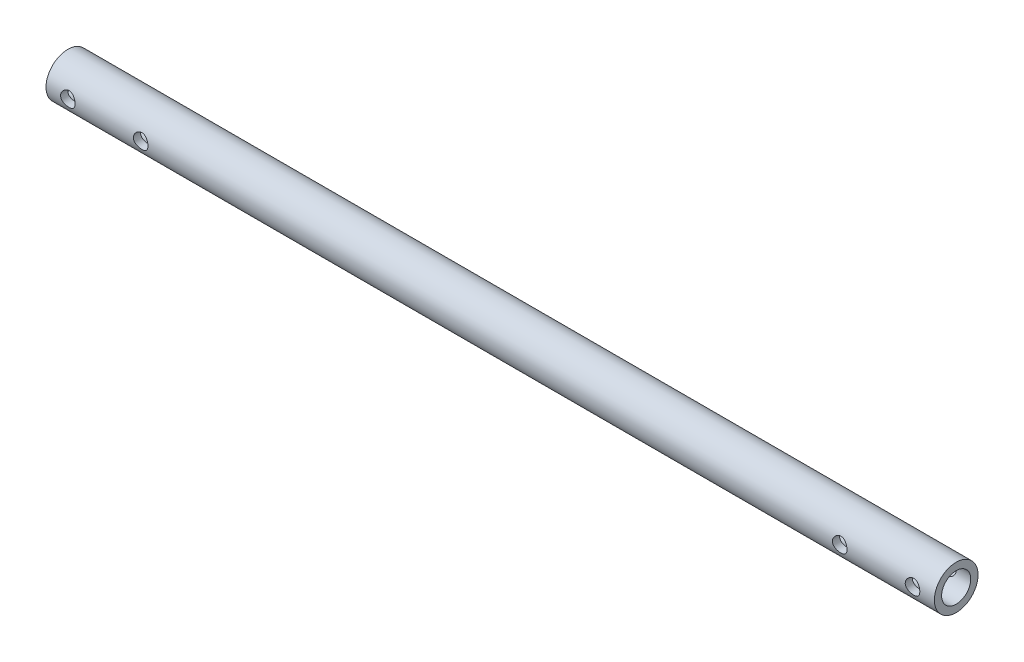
ISO-10303-21;
HEADER;
FILE_DESCRIPTION(('STEP AP214'),'2;1');
FILE_NAME('part.step','',(''),(''),'','','');
FILE_SCHEMA(('AUTOMOTIVE_DESIGN { 1 0 10303 214 1 1 1 1 }'));
ENDSEC;
DATA;
#1=APPLICATION_CONTEXT('core data for automotive mechanical design processes');
#2=APPLICATION_PROTOCOL_DEFINITION('international standard','automotive_design',2000,#1);
#3=PRODUCT_CONTEXT('',#1,'mechanical');
#4=PRODUCT('Part','Part','',(#3));
#5=PRODUCT_RELATED_PRODUCT_CATEGORY('part','',(#4));
#6=PRODUCT_DEFINITION_FORMATION('','',#4);
#7=PRODUCT_DEFINITION_CONTEXT('part definition',#1,'design');
#8=PRODUCT_DEFINITION('design','',#6,#7);
#9=PRODUCT_DEFINITION_SHAPE('','',#8);
#10=(LENGTH_UNIT() NAMED_UNIT(*) SI_UNIT(.MILLI.,.METRE.));
#11=(NAMED_UNIT(*) PLANE_ANGLE_UNIT() SI_UNIT($,.RADIAN.));
#12=(NAMED_UNIT(*) SI_UNIT($,.STERADIAN.) SOLID_ANGLE_UNIT());
#13=UNCERTAINTY_MEASURE_WITH_UNIT(LENGTH_MEASURE(1.E-05),#10,'distance_accuracy_value','');
#14=(GEOMETRIC_REPRESENTATION_CONTEXT(3) GLOBAL_UNCERTAINTY_ASSIGNED_CONTEXT((#13)) GLOBAL_UNIT_ASSIGNED_CONTEXT((#10,
#11,#12)) REPRESENTATION_CONTEXT('',''));
#15=CARTESIAN_POINT('',(0.,0.,0.));
#16=DIRECTION('',(0.,0.,1.));
#17=DIRECTION('',(1.,0.,0.));
#18=AXIS2_PLACEMENT_3D('',#15,#16,#17);
#19=CARTESIAN_POINT('',(0.,9.52499999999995,0.));
#20=DIRECTION('',(1.,0.,0.));
#21=DIRECTION('',(0.,0.,-1.));
#22=AXIS2_PLACEMENT_3D('',#19,#20,#21);
#23=PLANE('',#22);
#24=CARTESIAN_POINT('',(0.,0.,0.));
#25=DIRECTION('',(-1.,0.,0.));
#26=DIRECTION('',(0.,0.,1.));
#27=AXIS2_PLACEMENT_3D('',#24,#25,#26);
#28=CIRCLE('',#27,6.34999999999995);
#29=CARTESIAN_POINT('',(0.,0.,6.34999999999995));
#30=VERTEX_POINT('',#29);
#31=EDGE_CURVE('E10',#30,#30,#28,.T.);
#32=ORIENTED_EDGE('',*,*,#31,.F.);
#33=EDGE_LOOP('',(#32));
#34=FACE_BOUND('',#33,.T.);
#35=CARTESIAN_POINT('',(0.,0.,0.));
#36=DIRECTION('',(-1.,0.,0.));
#37=DIRECTION('',(0.,0.,1.));
#38=AXIS2_PLACEMENT_3D('',#35,#36,#37);
#39=CIRCLE('',#38,9.52499999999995);
#40=CARTESIAN_POINT('',(0.,0.,9.52499999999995));
#41=VERTEX_POINT('',#40);
#42=EDGE_CURVE('E184',#41,#41,#39,.T.);
#43=ORIENTED_EDGE('',*,*,#42,.T.);
#44=EDGE_LOOP('',(#43));
#45=FACE_BOUND('',#44,.T.);
#46=ADVANCED_FACE('F31',(#34,#45),#23,.F.);
#47=CARTESIAN_POINT('',(0.,0.,0.));
#48=DIRECTION('',(-1.,0.,0.));
#49=DIRECTION('',(0.,0.,1.));
#50=AXIS2_PLACEMENT_3D('',#47,#48,#49);
#51=CYLINDRICAL_SURFACE('',#50,6.34999999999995);
#52=CARTESIAN_POINT('',(381.,0.,6.34999999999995));
#53=CARTESIAN_POINT('',(380.999999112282,0.0834969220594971,6.34999931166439));
#54=CARTESIAN_POINT('',(380.996700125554,0.167002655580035,6.34834758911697));
#55=CARTESIAN_POINT('',(380.98355412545,0.33337833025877,6.3417910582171));
#56=CARTESIAN_POINT('',(380.973704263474,0.416247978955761,6.33688483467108));
#57=CARTESIAN_POINT('',(380.934427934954,0.663182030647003,6.3174242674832));
#58=CARTESIAN_POINT('',(380.895274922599,0.825450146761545,6.2981282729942));
#59=CARTESIAN_POINT('',(380.793009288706,1.13965128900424,6.24891823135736));
#60=CARTESIAN_POINT('',(380.729989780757,1.29162180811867,6.2190454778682));
#61=CARTESIAN_POINT('',(380.582263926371,1.58264035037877,6.15142812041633));
#62=CARTESIAN_POINT('',(380.497559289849,1.72168939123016,6.11368413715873));
#63=CARTESIAN_POINT('',(380.303030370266,1.99234108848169,6.03111096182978));
#64=CARTESIAN_POINT('',(380.191996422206,2.12298433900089,5.98599127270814));
#65=CARTESIAN_POINT('',(379.950603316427,2.36467069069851,5.89470535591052));
#66=CARTESIAN_POINT('',(379.820229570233,2.47569885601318,5.84853836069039));
#67=CARTESIAN_POINT('',(379.531579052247,2.68368848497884,5.7562363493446));
#68=CARTESIAN_POINT('',(379.371922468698,2.77889135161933,5.71038146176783));
#69=CARTESIAN_POINT('',(379.120452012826,2.90019349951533,5.64919759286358));
#70=CARTESIAN_POINT('',(379.034599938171,2.9370526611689,5.63006420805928));
#71=CARTESIAN_POINT('',(378.859414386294,3.00322508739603,5.59504604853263));
#72=CARTESIAN_POINT('',(378.770083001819,3.03254280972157,5.57915935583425));
#73=CARTESIAN_POINT('',(378.593989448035,3.0817426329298,5.55212611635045));
#74=CARTESIAN_POINT('',(378.507389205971,3.10208128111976,5.54075429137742));
#75=CARTESIAN_POINT('',(378.332412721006,3.13545600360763,5.5219365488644));
#76=CARTESIAN_POINT('',(378.244037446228,3.14849595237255,5.51448854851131));
#77=CARTESIAN_POINT('',(378.066293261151,3.16707713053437,5.50383875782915));
#78=CARTESIAN_POINT('',(377.976924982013,3.17262287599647,5.50063441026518));
#79=CARTESIAN_POINT('',(377.798019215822,3.1761477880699,5.49859788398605));
#80=CARTESIAN_POINT('',(377.708481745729,3.17412767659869,5.49976528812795));
#81=CARTESIAN_POINT('',(377.462252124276,3.15811930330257,5.50899190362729));
#82=CARTESIAN_POINT('',(377.306158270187,3.13621253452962,5.52160857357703));
#83=CARTESIAN_POINT('',(377.000353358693,3.07003746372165,5.55866493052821));
#84=CARTESIAN_POINT('',(376.850644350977,3.02576203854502,5.58310838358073));
#85=CARTESIAN_POINT('',(376.557455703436,2.91531509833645,5.64157885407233));
#86=CARTESIAN_POINT('',(376.414202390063,2.84865758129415,5.67581583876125));
#87=CARTESIAN_POINT('',(376.140233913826,2.69570761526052,5.75003268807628));
#88=CARTESIAN_POINT('',(376.009524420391,2.60940634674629,5.79001512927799));
#89=CARTESIAN_POINT('',(375.74689572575,2.40685964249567,5.87734289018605));
#90=CARTESIAN_POINT('',(375.616924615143,2.28820488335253,5.92497898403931));
#91=CARTESIAN_POINT('',(375.377914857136,2.03058898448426,6.01813700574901));
#92=CARTESIAN_POINT('',(375.268886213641,1.89161819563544,6.06365791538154));
#93=CARTESIAN_POINT('',(375.07009808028,1.58913989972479,6.15003810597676));
#94=CARTESIAN_POINT('',(374.98146851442,1.42479265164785,6.19058274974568));
#95=CARTESIAN_POINT('',(374.833841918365,1.08098023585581,6.25976272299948));
#96=CARTESIAN_POINT('',(374.774821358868,0.901527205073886,6.28840750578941));
#97=CARTESIAN_POINT('',(374.692940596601,0.548533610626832,6.32854759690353));
#98=CARTESIAN_POINT('',(374.667490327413,0.375734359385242,6.34126679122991));
#99=CARTESIAN_POINT('',(374.64534947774,0.0278752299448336,6.35231817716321));
#100=CARTESIAN_POINT('',(374.648645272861,-0.147183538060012,6.35065718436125));
#101=CARTESIAN_POINT('',(374.682406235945,-0.480164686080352,6.33384535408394));
#102=CARTESIAN_POINT('',(374.710745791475,-0.638363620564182,6.31975005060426));
#103=CARTESIAN_POINT('',(374.79045587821,-0.947441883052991,6.28085393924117));
#104=CARTESIAN_POINT('',(374.841828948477,-1.0983204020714,6.2560519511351));
#105=CARTESIAN_POINT('',(374.967495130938,-1.39347133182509,6.19709998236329));
#106=CARTESIAN_POINT('',(375.042401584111,-1.53743151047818,6.16270299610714));
#107=CARTESIAN_POINT('',(375.212316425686,-1.81121482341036,6.08787118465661));
#108=CARTESIAN_POINT('',(375.307333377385,-1.94103189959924,6.04743378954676));
#109=CARTESIAN_POINT('',(375.525539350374,-2.19636241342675,5.95973602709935));
#110=CARTESIAN_POINT('',(375.650578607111,-2.32020134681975,5.91219559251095));
#111=CARTESIAN_POINT('',(375.91976235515,-2.54589381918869,5.81858093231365));
#112=CARTESIAN_POINT('',(376.063919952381,-2.64773214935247,5.77250773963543));
#113=CARTESIAN_POINT('',(376.376068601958,-2.83117262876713,5.68487535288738));
#114=CARTESIAN_POINT('',(376.54487576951,-2.91155594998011,5.64364281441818));
#115=CARTESIAN_POINT('',(376.89634446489,-3.04191297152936,5.57447679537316));
#116=CARTESIAN_POINT('',(377.078987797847,-3.09192585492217,5.54652618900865));
#117=CARTESIAN_POINT('',(377.43418995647,-3.15551086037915,5.51057765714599));
#118=CARTESIAN_POINT('',(377.606033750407,-3.17212027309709,5.50092192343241));
#119=CARTESIAN_POINT('',(377.950244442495,-3.17718805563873,5.49800001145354));
#120=CARTESIAN_POINT('',(378.122611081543,-3.16565862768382,5.50472672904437));
#121=CARTESIAN_POINT('',(378.445660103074,-3.11761548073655,5.5320521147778));
#122=CARTESIAN_POINT('',(378.596843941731,-3.08358651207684,5.55126823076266));
#123=CARTESIAN_POINT('',(378.891190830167,-2.99458164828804,5.59977978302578));
#124=CARTESIAN_POINT('',(379.03435128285,-2.93959901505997,5.62907846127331));
#125=CARTESIAN_POINT('',(379.319233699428,-2.80611544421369,5.6968557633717));
#126=CARTESIAN_POINT('',(379.460212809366,-2.72628260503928,5.73581889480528));
#127=CARTESIAN_POINT('',(379.727697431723,-2.54682759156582,5.81772207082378));
#128=CARTESIAN_POINT('',(379.854195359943,-2.44719512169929,5.86066417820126));
#129=CARTESIAN_POINT('',(380.105097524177,-2.21680287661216,5.951927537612));
#130=CARTESIAN_POINT('',(380.227379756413,-2.08373188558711,6.00026839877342));
#131=CARTESIAN_POINT('',(380.448397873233,-1.79751265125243,6.09212345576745));
#132=CARTESIAN_POINT('',(380.547121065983,-1.64435365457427,6.13563504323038));
#133=CARTESIAN_POINT('',(380.675280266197,-1.40178715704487,6.19391073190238));
#134=CARTESIAN_POINT('',(380.714800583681,-1.31842200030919,6.21223173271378));
#135=CARTESIAN_POINT('',(380.786599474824,-1.14807701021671,6.24595363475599));
#136=CARTESIAN_POINT('',(380.818881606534,-1.06109897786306,6.26135597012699));
#137=CARTESIAN_POINT('',(380.875759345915,-0.884361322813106,6.28875097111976));
#138=CARTESIAN_POINT('',(380.900371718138,-0.794608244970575,6.30075106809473));
#139=CARTESIAN_POINT('',(380.94166738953,-0.612925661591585,6.32100983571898));
#140=CARTESIAN_POINT('',(380.958355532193,-0.520997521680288,6.32927079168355));
#141=CARTESIAN_POINT('',(380.980616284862,-0.35753134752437,6.34032503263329));
#142=CARTESIAN_POINT('',(380.98787882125,-0.286274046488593,6.34394670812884));
#143=CARTESIAN_POINT('',(380.997571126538,-0.143346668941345,6.34878452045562));
#144=CARTESIAN_POINT('',(381.000000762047,-0.0716765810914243,6.35000059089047));
#145=CARTESIAN_POINT('',(381.,0.,6.34999999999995));
#146=B_SPLINE_CURVE_WITH_KNOTS('',3,(#52,#53,#54,#55,#56,#57,#58,#59,#60,#61,#62,#63,#64,#65,
#66,#67,#68,#69,#70,#71,#72,#73,#74,#75,#76,#77,#78,#79,#80,#81,#82,#83,#84,#85,#86,#87,#88,#89,
#90,#91,#92,#93,#94,#95,#96,#97,#98,#99,#100,#101,#102,#103,#104,#105,#106,#107,#108,#109,#110,
#111,#112,#113,#114,#115,#116,#117,#118,#119,#120,#121,#122,#123,#124,#125,#126,#127,#128,#129,
#130,#131,#132,#133,#134,#135,#136,#137,#138,#139,#140,#141,#142,#143,#144,#145),.UNSPECIFIED.,
.T.,.F.,(4,2,2,2,2,2,2,2,2,2,2,2,2,2,2,2,2,2,2,2,2,2,2,2,2,2,2,2,2,2,2,2,2,2,2,2,2,2,2,2,2,2,2,
2,2,2,4),(0.,0.250415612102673,0.500940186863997,1.00234854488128,1.50182051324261,
2.00125310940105,2.53090025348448,3.06094897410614,3.63210298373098,3.91787290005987,
4.2034735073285,4.47213270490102,4.74064915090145,5.00900371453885,5.2773326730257,
5.74927594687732,6.22136960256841,6.70445970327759,7.18776712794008,7.7323564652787,
8.27720530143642,8.8473555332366,9.41705196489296,9.9395640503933,10.4618285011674,
10.9436138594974,11.4254523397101,11.9210677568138,12.4168946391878,12.9614122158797,
13.50630501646,14.0775857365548,14.6481278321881,15.1639000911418,15.6794487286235,
16.1458838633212,16.6124691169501,17.1104020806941,17.6085946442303,18.167321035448,
18.7263477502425,19.0082017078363,19.2899168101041,19.5710117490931,19.8519346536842,
20.0668939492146,20.2818591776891),.UNSPECIFIED.);
#147=CARTESIAN_POINT('',(381.,0.,6.34999999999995));
#148=VERTEX_POINT('',#147);
#149=EDGE_CURVE('E121',#148,#148,#146,.T.);
#150=ORIENTED_EDGE('',*,*,#149,.T.);
#151=EDGE_LOOP('',(#150));
#152=FACE_BOUND('',#151,.T.);
#153=CARTESIAN_POINT('',(381.,0.,-6.34999999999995));
#154=CARTESIAN_POINT('',(380.999999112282,-0.0834969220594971,-6.34999931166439));
#155=CARTESIAN_POINT('',(380.996700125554,-0.167002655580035,-6.34834758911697));
#156=CARTESIAN_POINT('',(380.98355412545,-0.33337833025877,-6.3417910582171));
#157=CARTESIAN_POINT('',(380.973704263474,-0.416247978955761,-6.33688483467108));
#158=CARTESIAN_POINT('',(380.934427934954,-0.663182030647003,-6.3174242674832));
#159=CARTESIAN_POINT('',(380.895274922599,-0.825450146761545,-6.2981282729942));
#160=CARTESIAN_POINT('',(380.793009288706,-1.13965128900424,-6.24891823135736));
#161=CARTESIAN_POINT('',(380.729989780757,-1.29162180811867,-6.2190454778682));
#162=CARTESIAN_POINT('',(380.582263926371,-1.58264035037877,-6.15142812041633));
#163=CARTESIAN_POINT('',(380.497559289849,-1.72168939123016,-6.11368413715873));
#164=CARTESIAN_POINT('',(380.303030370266,-1.99234108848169,-6.03111096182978));
#165=CARTESIAN_POINT('',(380.191996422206,-2.12298433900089,-5.98599127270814));
#166=CARTESIAN_POINT('',(379.950603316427,-2.36467069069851,-5.89470535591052));
#167=CARTESIAN_POINT('',(379.820229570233,-2.47569885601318,-5.84853836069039));
#168=CARTESIAN_POINT('',(379.531579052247,-2.68368848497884,-5.7562363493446));
#169=CARTESIAN_POINT('',(379.371922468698,-2.77889135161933,-5.71038146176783));
#170=CARTESIAN_POINT('',(379.120452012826,-2.90019349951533,-5.64919759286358));
#171=CARTESIAN_POINT('',(379.034599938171,-2.9370526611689,-5.63006420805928));
#172=CARTESIAN_POINT('',(378.859414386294,-3.00322508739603,-5.59504604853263));
#173=CARTESIAN_POINT('',(378.770083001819,-3.03254280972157,-5.57915935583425));
#174=CARTESIAN_POINT('',(378.593989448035,-3.0817426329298,-5.55212611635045));
#175=CARTESIAN_POINT('',(378.507389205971,-3.10208128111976,-5.54075429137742));
#176=CARTESIAN_POINT('',(378.332412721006,-3.13545600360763,-5.5219365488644));
#177=CARTESIAN_POINT('',(378.244037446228,-3.14849595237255,-5.51448854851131));
#178=CARTESIAN_POINT('',(378.066293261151,-3.16707713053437,-5.50383875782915));
#179=CARTESIAN_POINT('',(377.976924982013,-3.17262287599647,-5.50063441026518));
#180=CARTESIAN_POINT('',(377.798019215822,-3.1761477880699,-5.49859788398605));
#181=CARTESIAN_POINT('',(377.708481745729,-3.17412767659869,-5.49976528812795));
#182=CARTESIAN_POINT('',(377.462252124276,-3.15811930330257,-5.50899190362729));
#183=CARTESIAN_POINT('',(377.306158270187,-3.13621253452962,-5.52160857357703));
#184=CARTESIAN_POINT('',(377.000353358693,-3.07003746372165,-5.55866493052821));
#185=CARTESIAN_POINT('',(376.850644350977,-3.02576203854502,-5.58310838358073));
#186=CARTESIAN_POINT('',(376.557455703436,-2.91531509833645,-5.64157885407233));
#187=CARTESIAN_POINT('',(376.414202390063,-2.84865758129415,-5.67581583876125));
#188=CARTESIAN_POINT('',(376.140233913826,-2.69570761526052,-5.75003268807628));
#189=CARTESIAN_POINT('',(376.009524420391,-2.60940634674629,-5.79001512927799));
#190=CARTESIAN_POINT('',(375.74689572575,-2.40685964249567,-5.87734289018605));
#191=CARTESIAN_POINT('',(375.616924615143,-2.28820488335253,-5.92497898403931));
#192=CARTESIAN_POINT('',(375.377914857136,-2.03058898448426,-6.01813700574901));
#193=CARTESIAN_POINT('',(375.268886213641,-1.89161819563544,-6.06365791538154));
#194=CARTESIAN_POINT('',(375.07009808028,-1.58913989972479,-6.15003810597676));
#195=CARTESIAN_POINT('',(374.98146851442,-1.42479265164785,-6.19058274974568));
#196=CARTESIAN_POINT('',(374.833841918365,-1.08098023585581,-6.25976272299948));
#197=CARTESIAN_POINT('',(374.774821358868,-0.901527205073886,-6.28840750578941));
#198=CARTESIAN_POINT('',(374.692940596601,-0.548533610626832,-6.32854759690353));
#199=CARTESIAN_POINT('',(374.667490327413,-0.375734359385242,-6.34126679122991));
#200=CARTESIAN_POINT('',(374.64534947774,-0.0278752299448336,-6.35231817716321));
#201=CARTESIAN_POINT('',(374.648645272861,0.147183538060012,-6.35065718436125));
#202=CARTESIAN_POINT('',(374.682406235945,0.480164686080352,-6.33384535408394));
#203=CARTESIAN_POINT('',(374.710745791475,0.638363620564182,-6.31975005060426));
#204=CARTESIAN_POINT('',(374.79045587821,0.947441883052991,-6.28085393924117));
#205=CARTESIAN_POINT('',(374.841828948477,1.0983204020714,-6.2560519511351));
#206=CARTESIAN_POINT('',(374.967495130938,1.39347133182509,-6.19709998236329));
#207=CARTESIAN_POINT('',(375.042401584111,1.53743151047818,-6.16270299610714));
#208=CARTESIAN_POINT('',(375.212316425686,1.81121482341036,-6.08787118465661));
#209=CARTESIAN_POINT('',(375.307333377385,1.94103189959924,-6.04743378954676));
#210=CARTESIAN_POINT('',(375.525539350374,2.19636241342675,-5.95973602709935));
#211=CARTESIAN_POINT('',(375.650578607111,2.32020134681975,-5.91219559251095));
#212=CARTESIAN_POINT('',(375.91976235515,2.54589381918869,-5.81858093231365));
#213=CARTESIAN_POINT('',(376.063919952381,2.64773214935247,-5.77250773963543));
#214=CARTESIAN_POINT('',(376.376068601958,2.83117262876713,-5.68487535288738));
#215=CARTESIAN_POINT('',(376.54487576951,2.91155594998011,-5.64364281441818));
#216=CARTESIAN_POINT('',(376.89634446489,3.04191297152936,-5.57447679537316));
#217=CARTESIAN_POINT('',(377.078987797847,3.09192585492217,-5.54652618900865));
#218=CARTESIAN_POINT('',(377.43418995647,3.15551086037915,-5.51057765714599));
#219=CARTESIAN_POINT('',(377.606033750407,3.17212027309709,-5.50092192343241));
#220=CARTESIAN_POINT('',(377.950244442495,3.17718805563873,-5.49800001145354));
#221=CARTESIAN_POINT('',(378.122611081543,3.16565862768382,-5.50472672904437));
#222=CARTESIAN_POINT('',(378.445660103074,3.11761548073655,-5.5320521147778));
#223=CARTESIAN_POINT('',(378.596843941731,3.08358651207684,-5.55126823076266));
#224=CARTESIAN_POINT('',(378.891190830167,2.99458164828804,-5.59977978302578));
#225=CARTESIAN_POINT('',(379.03435128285,2.93959901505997,-5.62907846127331));
#226=CARTESIAN_POINT('',(379.319233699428,2.80611544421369,-5.6968557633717));
#227=CARTESIAN_POINT('',(379.460212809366,2.72628260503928,-5.73581889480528));
#228=CARTESIAN_POINT('',(379.727697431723,2.54682759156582,-5.81772207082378));
#229=CARTESIAN_POINT('',(379.854195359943,2.44719512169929,-5.86066417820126));
#230=CARTESIAN_POINT('',(380.105097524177,2.21680287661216,-5.951927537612));
#231=CARTESIAN_POINT('',(380.227379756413,2.08373188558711,-6.00026839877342));
#232=CARTESIAN_POINT('',(380.448397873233,1.79751265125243,-6.09212345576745));
#233=CARTESIAN_POINT('',(380.547121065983,1.64435365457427,-6.13563504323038));
#234=CARTESIAN_POINT('',(380.675280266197,1.40178715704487,-6.19391073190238));
#235=CARTESIAN_POINT('',(380.714800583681,1.31842200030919,-6.21223173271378));
#236=CARTESIAN_POINT('',(380.786599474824,1.14807701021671,-6.24595363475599));
#237=CARTESIAN_POINT('',(380.818881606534,1.06109897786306,-6.26135597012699));
#238=CARTESIAN_POINT('',(380.875759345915,0.884361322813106,-6.28875097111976));
#239=CARTESIAN_POINT('',(380.900371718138,0.794608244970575,-6.30075106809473));
#240=CARTESIAN_POINT('',(380.94166738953,0.612925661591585,-6.32100983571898));
#241=CARTESIAN_POINT('',(380.958355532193,0.520997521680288,-6.32927079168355));
#242=CARTESIAN_POINT('',(380.980616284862,0.35753134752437,-6.34032503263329));
#243=CARTESIAN_POINT('',(380.98787882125,0.286274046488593,-6.34394670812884));
#244=CARTESIAN_POINT('',(380.997571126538,0.143346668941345,-6.34878452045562));
#245=CARTESIAN_POINT('',(381.000000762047,0.0716765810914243,-6.35000059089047));
#246=CARTESIAN_POINT('',(381.,0.,-6.34999999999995));
#247=B_SPLINE_CURVE_WITH_KNOTS('',3,(#153,#154,#155,#156,#157,#158,#159,#160,#161,#162,#163,
#164,#165,#166,#167,#168,#169,#170,#171,#172,#173,#174,#175,#176,#177,#178,#179,#180,#181,#182,
#183,#184,#185,#186,#187,#188,#189,#190,#191,#192,#193,#194,#195,#196,#197,#198,#199,#200,#201,
#202,#203,#204,#205,#206,#207,#208,#209,#210,#211,#212,#213,#214,#215,#216,#217,#218,#219,#220,
#221,#222,#223,#224,#225,#226,#227,#228,#229,#230,#231,#232,#233,#234,#235,#236,#237,#238,#239,
#240,#241,#242,#243,#244,#245,#246),.UNSPECIFIED.,.T.,.F.,(4,2,2,2,2,2,2,2,2,2,2,2,2,2,2,2,2,2,
2,2,2,2,2,2,2,2,2,2,2,2,2,2,2,2,2,2,2,2,2,2,2,2,2,2,2,2,4),(0.,0.250415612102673,
0.500940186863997,1.00234854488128,1.50182051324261,2.00125310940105,2.53090025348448,
3.06094897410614,3.63210298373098,3.91787290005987,4.2034735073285,4.47213270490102,
4.74064915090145,5.00900371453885,5.2773326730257,5.74927594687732,6.22136960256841,
6.70445970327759,7.18776712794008,7.7323564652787,8.27720530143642,8.8473555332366,
9.41705196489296,9.9395640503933,10.4618285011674,10.9436138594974,11.4254523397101,
11.9210677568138,12.4168946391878,12.9614122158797,13.50630501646,14.0775857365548,
14.6481278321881,15.1639000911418,15.6794487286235,16.1458838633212,16.6124691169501,
17.1104020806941,17.6085946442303,18.167321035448,18.7263477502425,19.0082017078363,
19.2899168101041,19.5710117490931,19.8519346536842,20.0668939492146,20.2818591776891),.UNSPECIFIED.);
#248=CARTESIAN_POINT('',(381.,0.,-6.34999999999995));
#249=VERTEX_POINT('',#248);
#250=EDGE_CURVE('E117',#249,#249,#247,.T.);
#251=ORIENTED_EDGE('',*,*,#250,.T.);
#252=EDGE_LOOP('',(#251));
#253=FACE_BOUND('',#252,.T.);
#254=CARTESIAN_POINT('',(349.25,0.,6.34999999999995));
#255=CARTESIAN_POINT('',(349.249999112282,0.0834969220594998,6.34999931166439));
#256=CARTESIAN_POINT('',(349.246700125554,0.167002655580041,6.34834758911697));
#257=CARTESIAN_POINT('',(349.23355412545,0.333378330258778,6.3417910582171));
#258=CARTESIAN_POINT('',(349.223704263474,0.416247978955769,6.33688483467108));
#259=CARTESIAN_POINT('',(349.184427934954,0.663182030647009,6.3174242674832));
#260=CARTESIAN_POINT('',(349.145274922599,0.825450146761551,6.2981282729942));
#261=CARTESIAN_POINT('',(349.043009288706,1.13965128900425,6.24891823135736));
#262=CARTESIAN_POINT('',(348.979989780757,1.29162180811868,6.2190454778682));
#263=CARTESIAN_POINT('',(348.832263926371,1.58264035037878,6.15142812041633));
#264=CARTESIAN_POINT('',(348.747559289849,1.72168939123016,6.11368413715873));
#265=CARTESIAN_POINT('',(348.553030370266,1.9923410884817,6.03111096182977));
#266=CARTESIAN_POINT('',(348.441996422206,2.12298433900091,5.98599127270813));
#267=CARTESIAN_POINT('',(348.200603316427,2.36467069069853,5.89470535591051));
#268=CARTESIAN_POINT('',(348.070229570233,2.47569885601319,5.84853836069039));
#269=CARTESIAN_POINT('',(347.781579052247,2.68368848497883,5.75623634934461));
#270=CARTESIAN_POINT('',(347.621922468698,2.7788913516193,5.71038146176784));
#271=CARTESIAN_POINT('',(347.370452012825,2.90019349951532,5.64919759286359));
#272=CARTESIAN_POINT('',(347.284599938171,2.9370526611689,5.63006420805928));
#273=CARTESIAN_POINT('',(347.109414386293,3.00322508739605,5.59504604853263));
#274=CARTESIAN_POINT('',(347.020083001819,3.03254280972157,5.57915935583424));
#275=CARTESIAN_POINT('',(346.843989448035,3.0817426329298,5.55212611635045));
#276=CARTESIAN_POINT('',(346.757389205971,3.10208128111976,5.54075429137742));
#277=CARTESIAN_POINT('',(346.582412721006,3.13545600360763,5.5219365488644));
#278=CARTESIAN_POINT('',(346.494037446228,3.14849595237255,5.51448854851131));
#279=CARTESIAN_POINT('',(346.316293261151,3.16707713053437,5.50383875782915));
#280=CARTESIAN_POINT('',(346.226924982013,3.17262287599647,5.50063441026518));
#281=CARTESIAN_POINT('',(346.048019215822,3.1761477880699,5.49859788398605));
#282=CARTESIAN_POINT('',(345.958481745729,3.17412767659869,5.49976528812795));
#283=CARTESIAN_POINT('',(345.712252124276,3.15811930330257,5.50899190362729));
#284=CARTESIAN_POINT('',(345.556158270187,3.13621253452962,5.52160857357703));
#285=CARTESIAN_POINT('',(345.250353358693,3.07003746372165,5.55866493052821));
#286=CARTESIAN_POINT('',(345.100644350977,3.02576203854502,5.58310838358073));
#287=CARTESIAN_POINT('',(344.807455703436,2.91531509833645,5.64157885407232));
#288=CARTESIAN_POINT('',(344.664202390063,2.84865758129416,5.67581583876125));
#289=CARTESIAN_POINT('',(344.390233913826,2.69570761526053,5.75003268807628));
#290=CARTESIAN_POINT('',(344.259524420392,2.6094063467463,5.79001512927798));
#291=CARTESIAN_POINT('',(343.99689572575,2.40685964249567,5.87734289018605));
#292=CARTESIAN_POINT('',(343.866924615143,2.28820488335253,5.9249789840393));
#293=CARTESIAN_POINT('',(343.627914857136,2.03058898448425,6.01813700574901));
#294=CARTESIAN_POINT('',(343.518886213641,1.89161819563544,6.06365791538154));
#295=CARTESIAN_POINT('',(343.32009808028,1.58913989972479,6.15003810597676));
#296=CARTESIAN_POINT('',(343.23146851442,1.42479265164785,6.19058274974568));
#297=CARTESIAN_POINT('',(343.083841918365,1.08098023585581,6.25976272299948));
#298=CARTESIAN_POINT('',(343.024821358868,0.901527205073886,6.28840750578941));
#299=CARTESIAN_POINT('',(342.942940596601,0.548533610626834,6.32854759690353));
#300=CARTESIAN_POINT('',(342.917490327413,0.375734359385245,6.34126679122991));
#301=CARTESIAN_POINT('',(342.89534947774,0.0278752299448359,6.35231817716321));
#302=CARTESIAN_POINT('',(342.898645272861,-0.147183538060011,6.35065718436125));
#303=CARTESIAN_POINT('',(342.932406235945,-0.480164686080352,6.33384535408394));
#304=CARTESIAN_POINT('',(342.960745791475,-0.638363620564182,6.31975005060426));
#305=CARTESIAN_POINT('',(343.04045587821,-0.947441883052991,6.28085393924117));
#306=CARTESIAN_POINT('',(343.091828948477,-1.0983204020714,6.2560519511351));
#307=CARTESIAN_POINT('',(343.217495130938,-1.39347133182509,6.19709998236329));
#308=CARTESIAN_POINT('',(343.292401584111,-1.53743151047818,6.16270299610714));
#309=CARTESIAN_POINT('',(343.462316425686,-1.81121482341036,6.08787118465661));
#310=CARTESIAN_POINT('',(343.557333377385,-1.94103189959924,6.04743378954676));
#311=CARTESIAN_POINT('',(343.775539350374,-2.19636241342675,5.95973602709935));
#312=CARTESIAN_POINT('',(343.900578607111,-2.32020134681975,5.91219559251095));
#313=CARTESIAN_POINT('',(344.16976235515,-2.54589381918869,5.81858093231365));
#314=CARTESIAN_POINT('',(344.313919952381,-2.64773214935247,5.77250773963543));
#315=CARTESIAN_POINT('',(344.626068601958,-2.83117262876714,5.68487535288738));
#316=CARTESIAN_POINT('',(344.79487576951,-2.91155594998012,5.64364281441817));
#317=CARTESIAN_POINT('',(345.14634446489,-3.04191297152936,5.57447679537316));
#318=CARTESIAN_POINT('',(345.328987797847,-3.09192585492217,5.54652618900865));
#319=CARTESIAN_POINT('',(345.68418995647,-3.15551086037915,5.51057765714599));
#320=CARTESIAN_POINT('',(345.856033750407,-3.17212027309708,5.50092192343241));
#321=CARTESIAN_POINT('',(346.200244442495,-3.17718805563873,5.49800001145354));
#322=CARTESIAN_POINT('',(346.372611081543,-3.16565862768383,5.50472672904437));
#323=CARTESIAN_POINT('',(346.695660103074,-3.11761548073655,5.5320521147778));
#324=CARTESIAN_POINT('',(346.846843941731,-3.08358651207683,5.55126823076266));
#325=CARTESIAN_POINT('',(347.141190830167,-2.99458164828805,5.59977978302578));
#326=CARTESIAN_POINT('',(347.28435128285,-2.93959901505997,5.62907846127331));
#327=CARTESIAN_POINT('',(347.569233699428,-2.80611544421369,5.69685576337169));
#328=CARTESIAN_POINT('',(347.710212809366,-2.72628260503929,5.73581889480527));
#329=CARTESIAN_POINT('',(347.977697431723,-2.54682759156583,5.81772207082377));
#330=CARTESIAN_POINT('',(348.104195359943,-2.4471951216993,5.86066417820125));
#331=CARTESIAN_POINT('',(348.355097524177,-2.21680287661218,5.95192753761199));
#332=CARTESIAN_POINT('',(348.477379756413,-2.08373188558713,6.00026839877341));
#333=CARTESIAN_POINT('',(348.698397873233,-1.79751265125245,6.09212345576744));
#334=CARTESIAN_POINT('',(348.797121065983,-1.64435365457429,6.13563504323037));
#335=CARTESIAN_POINT('',(348.925280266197,-1.40178715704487,6.19391073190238));
#336=CARTESIAN_POINT('',(348.964800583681,-1.31842200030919,6.21223173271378));
#337=CARTESIAN_POINT('',(349.036599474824,-1.14807701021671,6.24595363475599));
#338=CARTESIAN_POINT('',(349.068881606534,-1.06109897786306,6.26135597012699));
#339=CARTESIAN_POINT('',(349.125759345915,-0.884361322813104,6.28875097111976));
#340=CARTESIAN_POINT('',(349.150371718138,-0.794608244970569,6.30075106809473));
#341=CARTESIAN_POINT('',(349.19166738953,-0.612925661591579,6.32100983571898));
#342=CARTESIAN_POINT('',(349.208355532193,-0.520997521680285,6.32927079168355));
#343=CARTESIAN_POINT('',(349.230616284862,-0.35753134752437,6.34032503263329));
#344=CARTESIAN_POINT('',(349.23787882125,-0.286274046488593,6.34394670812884));
#345=CARTESIAN_POINT('',(349.247571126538,-0.143346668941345,6.34878452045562));
#346=CARTESIAN_POINT('',(349.250000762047,-0.0716765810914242,6.35000059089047));
#347=CARTESIAN_POINT('',(349.25,0.,6.34999999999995));
#348=B_SPLINE_CURVE_WITH_KNOTS('',3,(#254,#255,#256,#257,#258,#259,#260,#261,#262,#263,#264,
#265,#266,#267,#268,#269,#270,#271,#272,#273,#274,#275,#276,#277,#278,#279,#280,#281,#282,#283,
#284,#285,#286,#287,#288,#289,#290,#291,#292,#293,#294,#295,#296,#297,#298,#299,#300,#301,#302,
#303,#304,#305,#306,#307,#308,#309,#310,#311,#312,#313,#314,#315,#316,#317,#318,#319,#320,#321,
#322,#323,#324,#325,#326,#327,#328,#329,#330,#331,#332,#333,#334,#335,#336,#337,#338,#339,#340,
#341,#342,#343,#344,#345,#346,#347),.UNSPECIFIED.,.T.,.F.,(4,2,2,2,2,2,2,2,2,2,2,2,2,2,2,2,2,2,
2,2,2,2,2,2,2,2,2,2,2,2,2,2,2,2,2,2,2,2,2,2,2,2,2,2,2,2,4),(0.,0.250415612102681,
0.500940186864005,1.00234854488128,1.50182051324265,2.00125310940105,2.5309002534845,
3.06094897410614,3.63210298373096,3.91787290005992,4.20347350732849,4.47213270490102,
4.74064915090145,5.00900371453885,5.2773326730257,5.74927594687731,6.22136960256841,
6.70445970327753,7.18776712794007,7.73235646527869,8.27720530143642,8.84735553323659,
9.41705196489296,9.9395640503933,10.4618285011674,10.9436138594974,11.4254523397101,
11.9210677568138,12.4168946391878,12.9614122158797,13.50630501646,14.0775857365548,
14.6481278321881,15.1639000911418,15.6794487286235,16.1458838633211,16.6124691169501,
17.110402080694,17.6085946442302,18.1673210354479,18.7263477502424,19.0082017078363,
19.289916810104,19.5710117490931,19.8519346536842,20.0668939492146,20.281859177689),.UNSPECIFIED.);
#349=CARTESIAN_POINT('',(349.25,0.,6.34999999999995));
#350=VERTEX_POINT('',#349);
#351=EDGE_CURVE('E113',#350,#350,#348,.T.);
#352=ORIENTED_EDGE('',*,*,#351,.T.);
#353=EDGE_LOOP('',(#352));
#354=FACE_BOUND('',#353,.T.);
#355=CARTESIAN_POINT('',(349.25,0.,-6.34999999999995));
#356=CARTESIAN_POINT('',(349.249999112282,-0.0834969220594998,-6.34999931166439));
#357=CARTESIAN_POINT('',(349.246700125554,-0.167002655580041,-6.34834758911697));
#358=CARTESIAN_POINT('',(349.23355412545,-0.333378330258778,-6.3417910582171));
#359=CARTESIAN_POINT('',(349.223704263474,-0.416247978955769,-6.33688483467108));
#360=CARTESIAN_POINT('',(349.184427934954,-0.663182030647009,-6.3174242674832));
#361=CARTESIAN_POINT('',(349.145274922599,-0.825450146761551,-6.2981282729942));
#362=CARTESIAN_POINT('',(349.043009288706,-1.13965128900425,-6.24891823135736));
#363=CARTESIAN_POINT('',(348.979989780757,-1.29162180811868,-6.2190454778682));
#364=CARTESIAN_POINT('',(348.832263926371,-1.58264035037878,-6.15142812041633));
#365=CARTESIAN_POINT('',(348.747559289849,-1.72168939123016,-6.11368413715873));
#366=CARTESIAN_POINT('',(348.553030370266,-1.9923410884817,-6.03111096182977));
#367=CARTESIAN_POINT('',(348.441996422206,-2.12298433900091,-5.98599127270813));
#368=CARTESIAN_POINT('',(348.200603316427,-2.36467069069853,-5.89470535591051));
#369=CARTESIAN_POINT('',(348.070229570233,-2.47569885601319,-5.84853836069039));
#370=CARTESIAN_POINT('',(347.781579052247,-2.68368848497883,-5.75623634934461));
#371=CARTESIAN_POINT('',(347.621922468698,-2.7788913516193,-5.71038146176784));
#372=CARTESIAN_POINT('',(347.370452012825,-2.90019349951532,-5.64919759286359));
#373=CARTESIAN_POINT('',(347.284599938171,-2.9370526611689,-5.63006420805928));
#374=CARTESIAN_POINT('',(347.109414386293,-3.00322508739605,-5.59504604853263));
#375=CARTESIAN_POINT('',(347.020083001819,-3.03254280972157,-5.57915935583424));
#376=CARTESIAN_POINT('',(346.843989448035,-3.0817426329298,-5.55212611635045));
#377=CARTESIAN_POINT('',(346.757389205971,-3.10208128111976,-5.54075429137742));
#378=CARTESIAN_POINT('',(346.582412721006,-3.13545600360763,-5.5219365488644));
#379=CARTESIAN_POINT('',(346.494037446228,-3.14849595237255,-5.51448854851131));
#380=CARTESIAN_POINT('',(346.316293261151,-3.16707713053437,-5.50383875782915));
#381=CARTESIAN_POINT('',(346.226924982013,-3.17262287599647,-5.50063441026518));
#382=CARTESIAN_POINT('',(346.048019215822,-3.1761477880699,-5.49859788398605));
#383=CARTESIAN_POINT('',(345.958481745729,-3.17412767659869,-5.49976528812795));
#384=CARTESIAN_POINT('',(345.712252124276,-3.15811930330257,-5.50899190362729));
#385=CARTESIAN_POINT('',(345.556158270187,-3.13621253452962,-5.52160857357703));
#386=CARTESIAN_POINT('',(345.250353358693,-3.07003746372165,-5.55866493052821));
#387=CARTESIAN_POINT('',(345.100644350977,-3.02576203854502,-5.58310838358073));
#388=CARTESIAN_POINT('',(344.807455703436,-2.91531509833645,-5.64157885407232));
#389=CARTESIAN_POINT('',(344.664202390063,-2.84865758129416,-5.67581583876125));
#390=CARTESIAN_POINT('',(344.390233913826,-2.69570761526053,-5.75003268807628));
#391=CARTESIAN_POINT('',(344.259524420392,-2.6094063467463,-5.79001512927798));
#392=CARTESIAN_POINT('',(343.99689572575,-2.40685964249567,-5.87734289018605));
#393=CARTESIAN_POINT('',(343.866924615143,-2.28820488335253,-5.9249789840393));
#394=CARTESIAN_POINT('',(343.627914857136,-2.03058898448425,-6.01813700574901));
#395=CARTESIAN_POINT('',(343.518886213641,-1.89161819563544,-6.06365791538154));
#396=CARTESIAN_POINT('',(343.32009808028,-1.58913989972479,-6.15003810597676));
#397=CARTESIAN_POINT('',(343.23146851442,-1.42479265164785,-6.19058274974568));
#398=CARTESIAN_POINT('',(343.083841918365,-1.08098023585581,-6.25976272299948));
#399=CARTESIAN_POINT('',(343.024821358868,-0.901527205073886,-6.28840750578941));
#400=CARTESIAN_POINT('',(342.942940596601,-0.548533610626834,-6.32854759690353));
#401=CARTESIAN_POINT('',(342.917490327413,-0.375734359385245,-6.34126679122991));
#402=CARTESIAN_POINT('',(342.89534947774,-0.0278752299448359,-6.35231817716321));
#403=CARTESIAN_POINT('',(342.898645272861,0.147183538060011,-6.35065718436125));
#404=CARTESIAN_POINT('',(342.932406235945,0.480164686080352,-6.33384535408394));
#405=CARTESIAN_POINT('',(342.960745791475,0.638363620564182,-6.31975005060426));
#406=CARTESIAN_POINT('',(343.04045587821,0.947441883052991,-6.28085393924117));
#407=CARTESIAN_POINT('',(343.091828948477,1.0983204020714,-6.2560519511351));
#408=CARTESIAN_POINT('',(343.217495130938,1.39347133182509,-6.19709998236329));
#409=CARTESIAN_POINT('',(343.292401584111,1.53743151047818,-6.16270299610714));
#410=CARTESIAN_POINT('',(343.462316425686,1.81121482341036,-6.08787118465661));
#411=CARTESIAN_POINT('',(343.557333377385,1.94103189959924,-6.04743378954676));
#412=CARTESIAN_POINT('',(343.775539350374,2.19636241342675,-5.95973602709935));
#413=CARTESIAN_POINT('',(343.900578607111,2.32020134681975,-5.91219559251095));
#414=CARTESIAN_POINT('',(344.16976235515,2.54589381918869,-5.81858093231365));
#415=CARTESIAN_POINT('',(344.313919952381,2.64773214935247,-5.77250773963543));
#416=CARTESIAN_POINT('',(344.626068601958,2.83117262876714,-5.68487535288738));
#417=CARTESIAN_POINT('',(344.79487576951,2.91155594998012,-5.64364281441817));
#418=CARTESIAN_POINT('',(345.14634446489,3.04191297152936,-5.57447679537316));
#419=CARTESIAN_POINT('',(345.328987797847,3.09192585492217,-5.54652618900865));
#420=CARTESIAN_POINT('',(345.68418995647,3.15551086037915,-5.51057765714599));
#421=CARTESIAN_POINT('',(345.856033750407,3.17212027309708,-5.50092192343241));
#422=CARTESIAN_POINT('',(346.200244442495,3.17718805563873,-5.49800001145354));
#423=CARTESIAN_POINT('',(346.372611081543,3.16565862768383,-5.50472672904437));
#424=CARTESIAN_POINT('',(346.695660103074,3.11761548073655,-5.5320521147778));
#425=CARTESIAN_POINT('',(346.846843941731,3.08358651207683,-5.55126823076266));
#426=CARTESIAN_POINT('',(347.141190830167,2.99458164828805,-5.59977978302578));
#427=CARTESIAN_POINT('',(347.28435128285,2.93959901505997,-5.62907846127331));
#428=CARTESIAN_POINT('',(347.569233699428,2.80611544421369,-5.69685576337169));
#429=CARTESIAN_POINT('',(347.710212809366,2.72628260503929,-5.73581889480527));
#430=CARTESIAN_POINT('',(347.977697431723,2.54682759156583,-5.81772207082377));
#431=CARTESIAN_POINT('',(348.104195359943,2.4471951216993,-5.86066417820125));
#432=CARTESIAN_POINT('',(348.355097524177,2.21680287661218,-5.95192753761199));
#433=CARTESIAN_POINT('',(348.477379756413,2.08373188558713,-6.00026839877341));
#434=CARTESIAN_POINT('',(348.698397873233,1.79751265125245,-6.09212345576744));
#435=CARTESIAN_POINT('',(348.797121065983,1.64435365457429,-6.13563504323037));
#436=CARTESIAN_POINT('',(348.925280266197,1.40178715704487,-6.19391073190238));
#437=CARTESIAN_POINT('',(348.964800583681,1.31842200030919,-6.21223173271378));
#438=CARTESIAN_POINT('',(349.036599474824,1.14807701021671,-6.24595363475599));
#439=CARTESIAN_POINT('',(349.068881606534,1.06109897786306,-6.26135597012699));
#440=CARTESIAN_POINT('',(349.125759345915,0.884361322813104,-6.28875097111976));
#441=CARTESIAN_POINT('',(349.150371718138,0.794608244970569,-6.30075106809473));
#442=CARTESIAN_POINT('',(349.19166738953,0.612925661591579,-6.32100983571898));
#443=CARTESIAN_POINT('',(349.208355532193,0.520997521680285,-6.32927079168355));
#444=CARTESIAN_POINT('',(349.230616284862,0.35753134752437,-6.34032503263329));
#445=CARTESIAN_POINT('',(349.23787882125,0.286274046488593,-6.34394670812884));
#446=CARTESIAN_POINT('',(349.247571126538,0.143346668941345,-6.34878452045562));
#447=CARTESIAN_POINT('',(349.250000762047,0.0716765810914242,-6.35000059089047));
#448=CARTESIAN_POINT('',(349.25,0.,-6.34999999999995));
#449=B_SPLINE_CURVE_WITH_KNOTS('',3,(#355,#356,#357,#358,#359,#360,#361,#362,#363,#364,#365,
#366,#367,#368,#369,#370,#371,#372,#373,#374,#375,#376,#377,#378,#379,#380,#381,#382,#383,#384,
#385,#386,#387,#388,#389,#390,#391,#392,#393,#394,#395,#396,#397,#398,#399,#400,#401,#402,#403,
#404,#405,#406,#407,#408,#409,#410,#411,#412,#413,#414,#415,#416,#417,#418,#419,#420,#421,#422,
#423,#424,#425,#426,#427,#428,#429,#430,#431,#432,#433,#434,#435,#436,#437,#438,#439,#440,#441,
#442,#443,#444,#445,#446,#447,#448),.UNSPECIFIED.,.T.,.F.,(4,2,2,2,2,2,2,2,2,2,2,2,2,2,2,2,2,2,
2,2,2,2,2,2,2,2,2,2,2,2,2,2,2,2,2,2,2,2,2,2,2,2,2,2,2,2,4),(0.,0.250415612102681,
0.500940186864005,1.00234854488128,1.50182051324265,2.00125310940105,2.5309002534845,
3.06094897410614,3.63210298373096,3.91787290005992,4.20347350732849,4.47213270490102,
4.74064915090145,5.00900371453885,5.2773326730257,5.74927594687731,6.22136960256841,
6.70445970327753,7.18776712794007,7.73235646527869,8.27720530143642,8.84735553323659,
9.41705196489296,9.9395640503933,10.4618285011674,10.9436138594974,11.4254523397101,
11.9210677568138,12.4168946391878,12.9614122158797,13.50630501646,14.0775857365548,
14.6481278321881,15.1639000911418,15.6794487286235,16.1458838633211,16.6124691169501,
17.110402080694,17.6085946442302,18.1673210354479,18.7263477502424,19.0082017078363,
19.289916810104,19.5710117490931,19.8519346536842,20.0668939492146,20.281859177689),.UNSPECIFIED.);
#450=CARTESIAN_POINT('',(349.25,0.,-6.34999999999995));
#451=VERTEX_POINT('',#450);
#452=EDGE_CURVE('E110',#451,#451,#449,.T.);
#453=ORIENTED_EDGE('',*,*,#452,.T.);
#454=EDGE_LOOP('',(#453));
#455=FACE_BOUND('',#454,.T.);
#456=CARTESIAN_POINT('',(44.45,0.,6.34999999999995));
#457=CARTESIAN_POINT('',(44.4499991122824,0.0834969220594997,6.34999931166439));
#458=CARTESIAN_POINT('',(44.4467001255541,0.167002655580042,6.34834758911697));
#459=CARTESIAN_POINT('',(44.4335541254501,0.333378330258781,6.3417910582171));
#460=CARTESIAN_POINT('',(44.4237042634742,0.416247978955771,6.33688483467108));
#461=CARTESIAN_POINT('',(44.384427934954,0.663182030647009,6.3174242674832));
#462=CARTESIAN_POINT('',(44.3452749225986,0.825450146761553,6.2981282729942));
#463=CARTESIAN_POINT('',(44.2430092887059,1.13965128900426,6.24891823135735));
#464=CARTESIAN_POINT('',(44.1799897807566,1.29162180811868,6.2190454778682));
#465=CARTESIAN_POINT('',(44.0322639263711,1.58264035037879,6.15142812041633));
#466=CARTESIAN_POINT('',(43.947559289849,1.72168939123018,6.11368413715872));
#467=CARTESIAN_POINT('',(43.7530303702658,1.99234108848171,6.03111096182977));
#468=CARTESIAN_POINT('',(43.6419964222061,2.12298433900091,5.98599127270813));
#469=CARTESIAN_POINT('',(43.4006033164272,2.36467069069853,5.89470535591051));
#470=CARTESIAN_POINT('',(43.2702295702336,2.47569885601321,5.84853836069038));
#471=CARTESIAN_POINT('',(42.9815790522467,2.68368848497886,5.75623634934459));
#472=CARTESIAN_POINT('',(42.8219224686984,2.77889135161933,5.71038146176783));
#473=CARTESIAN_POINT('',(42.5704520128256,2.90019349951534,5.64919759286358));
#474=CARTESIAN_POINT('',(42.4845999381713,2.93705266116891,5.63006420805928));
#475=CARTESIAN_POINT('',(42.3094143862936,3.00322508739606,5.59504604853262));
#476=CARTESIAN_POINT('',(42.2200830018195,3.03254280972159,5.57915935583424));
#477=CARTESIAN_POINT('',(42.0439894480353,3.08174263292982,5.55212611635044));
#478=CARTESIAN_POINT('',(41.9573892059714,3.10208128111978,5.54075429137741));
#479=CARTESIAN_POINT('',(41.7824127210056,3.13545600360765,5.52193654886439));
#480=CARTESIAN_POINT('',(41.6940374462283,3.14849595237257,5.5144885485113));
#481=CARTESIAN_POINT('',(41.5162932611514,3.1670771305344,5.50383875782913));
#482=CARTESIAN_POINT('',(41.4269249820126,3.17262287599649,5.50063441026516));
#483=CARTESIAN_POINT('',(41.2480192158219,3.17614778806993,5.49859788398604));
#484=CARTESIAN_POINT('',(41.1584817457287,3.17412767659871,5.49976528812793));
#485=CARTESIAN_POINT('',(40.9122521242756,3.1581193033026,5.50899190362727));
#486=CARTESIAN_POINT('',(40.7561582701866,3.13621253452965,5.52160857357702));
#487=CARTESIAN_POINT('',(40.4503533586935,3.07003746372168,5.55866493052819));
#488=CARTESIAN_POINT('',(40.3006443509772,3.02576203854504,5.58310838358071));
#489=CARTESIAN_POINT('',(40.0074557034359,2.91531509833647,5.64157885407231));
#490=CARTESIAN_POINT('',(39.8642023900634,2.84865758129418,5.67581583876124));
#491=CARTESIAN_POINT('',(39.590233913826,2.69570761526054,5.75003268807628));
#492=CARTESIAN_POINT('',(39.4595244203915,2.60940634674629,5.79001512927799));
#493=CARTESIAN_POINT('',(39.1968957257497,2.40685964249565,5.87734289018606));
#494=CARTESIAN_POINT('',(39.0669246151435,2.28820488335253,5.92497898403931));
#495=CARTESIAN_POINT('',(38.8279148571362,2.03058898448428,6.018137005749));
#496=CARTESIAN_POINT('',(38.7188862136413,1.89161819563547,6.06365791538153));
#497=CARTESIAN_POINT('',(38.5200980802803,1.58913989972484,6.15003810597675));
#498=CARTESIAN_POINT('',(38.4314685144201,1.42479265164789,6.19058274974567));
#499=CARTESIAN_POINT('',(38.2838419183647,1.08098023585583,6.25976272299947));
#500=CARTESIAN_POINT('',(38.2248213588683,0.9015272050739,6.28840750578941));
#501=CARTESIAN_POINT('',(38.142940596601,0.548533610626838,6.32854759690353));
#502=CARTESIAN_POINT('',(38.1174903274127,0.375734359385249,6.34126679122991));
#503=CARTESIAN_POINT('',(38.0953494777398,0.0278752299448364,6.3523181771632));
#504=CARTESIAN_POINT('',(38.0986452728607,-0.147183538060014,6.35065718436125));
#505=CARTESIAN_POINT('',(38.1324062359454,-0.480164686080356,6.33384535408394));
#506=CARTESIAN_POINT('',(38.1607457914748,-0.638363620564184,6.31975005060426));
#507=CARTESIAN_POINT('',(38.2404558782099,-0.947441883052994,6.28085393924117));
#508=CARTESIAN_POINT('',(38.2918289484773,-1.0983204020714,6.2560519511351));
#509=CARTESIAN_POINT('',(38.4174951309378,-1.39347133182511,6.19709998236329));
#510=CARTESIAN_POINT('',(38.4924015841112,-1.53743151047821,6.16270299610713));
#511=CARTESIAN_POINT('',(38.6623164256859,-1.81121482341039,6.0878711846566));
#512=CARTESIAN_POINT('',(38.7573333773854,-1.94103189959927,6.04743378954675));
#513=CARTESIAN_POINT('',(38.9755393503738,-2.19636241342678,5.95973602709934));
#514=CARTESIAN_POINT('',(39.1005786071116,-2.32020134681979,5.91219559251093));
#515=CARTESIAN_POINT('',(39.3697623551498,-2.54589381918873,5.81858093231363));
#516=CARTESIAN_POINT('',(39.5139199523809,-2.6477321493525,5.77250773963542));
#517=CARTESIAN_POINT('',(39.8260686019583,-2.83117262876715,5.68487535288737));
#518=CARTESIAN_POINT('',(39.9948757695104,-2.91155594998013,5.64364281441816));
#519=CARTESIAN_POINT('',(40.3463444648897,-3.04191297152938,5.57447679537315));
#520=CARTESIAN_POINT('',(40.5289877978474,-3.09192585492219,5.54652618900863));
#521=CARTESIAN_POINT('',(40.8841899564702,-3.15551086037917,5.51057765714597));
#522=CARTESIAN_POINT('',(41.0560337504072,-3.17212027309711,5.50092192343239));
#523=CARTESIAN_POINT('',(41.4002444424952,-3.17718805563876,5.49800001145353));
#524=CARTESIAN_POINT('',(41.5726110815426,-3.16565862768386,5.50472672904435));
#525=CARTESIAN_POINT('',(41.8956601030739,-3.11761548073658,5.53205211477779));
#526=CARTESIAN_POINT('',(42.0468439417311,-3.08358651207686,5.55126823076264));
#527=CARTESIAN_POINT('',(42.3411908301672,-2.99458164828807,5.59977978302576));
#528=CARTESIAN_POINT('',(42.4843512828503,-2.93959901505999,5.62907846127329));
#529=CARTESIAN_POINT('',(42.7692336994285,-2.80611544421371,5.69685576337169));
#530=CARTESIAN_POINT('',(42.9102128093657,-2.7262826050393,5.73581889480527));
#531=CARTESIAN_POINT('',(43.1776974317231,-2.54682759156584,5.81772207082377));
#532=CARTESIAN_POINT('',(43.3041953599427,-2.44719512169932,5.86066417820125));
#533=CARTESIAN_POINT('',(43.5550975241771,-2.21680287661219,5.95192753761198));
#534=CARTESIAN_POINT('',(43.6773797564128,-2.08373188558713,6.00026839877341));
#535=CARTESIAN_POINT('',(43.8983978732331,-1.79751265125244,6.09212345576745));
#536=CARTESIAN_POINT('',(43.9971210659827,-1.64435365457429,6.13563504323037));
#537=CARTESIAN_POINT('',(44.1252802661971,-1.40178715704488,6.19391073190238));
#538=CARTESIAN_POINT('',(44.1648005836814,-1.31842200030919,6.21223173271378));
#539=CARTESIAN_POINT('',(44.2365994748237,-1.14807701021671,6.24595363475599));
#540=CARTESIAN_POINT('',(44.2688816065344,-1.06109897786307,6.26135597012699));
#541=CARTESIAN_POINT('',(44.325759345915,-0.884361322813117,6.28875097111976));
#542=CARTESIAN_POINT('',(44.3503717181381,-0.794608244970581,6.30075106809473));
#543=CARTESIAN_POINT('',(44.3916673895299,-0.612925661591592,6.32100983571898));
#544=CARTESIAN_POINT('',(44.4083555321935,-0.520997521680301,6.32927079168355));
#545=CARTESIAN_POINT('',(44.4306162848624,-0.357531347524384,6.34032503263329));
#546=CARTESIAN_POINT('',(44.4378788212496,-0.286274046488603,6.34394670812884));
#547=CARTESIAN_POINT('',(44.4475711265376,-0.14334666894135,6.34878452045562));
#548=CARTESIAN_POINT('',(44.4500007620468,-0.0716765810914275,6.35000059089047));
#549=CARTESIAN_POINT('',(44.45,0.,6.34999999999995));
#550=B_SPLINE_CURVE_WITH_KNOTS('',3,(#456,#457,#458,#459,#460,#461,#462,#463,#464,#465,#466,
#467,#468,#469,#470,#471,#472,#473,#474,#475,#476,#477,#478,#479,#480,#481,#482,#483,#484,#485,
#486,#487,#488,#489,#490,#491,#492,#493,#494,#495,#496,#497,#498,#499,#500,#501,#502,#503,#504,
#505,#506,#507,#508,#509,#510,#511,#512,#513,#514,#515,#516,#517,#518,#519,#520,#521,#522,#523,
#524,#525,#526,#527,#528,#529,#530,#531,#532,#533,#534,#535,#536,#537,#538,#539,#540,#541,#542,
#543,#544,#545,#546,#547,#548,#549),.UNSPECIFIED.,.T.,.F.,(4,2,2,2,2,2,2,2,2,2,2,2,2,2,2,2,2,2,
2,2,2,2,2,2,2,2,2,2,2,2,2,2,2,2,2,2,2,2,2,2,2,2,2,2,2,2,4),(0.,0.250415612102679,
0.500940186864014,1.00234854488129,1.50182051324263,2.00125310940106,2.53090025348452,
3.06094897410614,3.63210298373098,3.91787290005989,4.20347350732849,4.47213270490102,
4.74064915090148,5.00900371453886,5.27733267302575,5.74927594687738,6.22136960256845,
6.70445970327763,7.1877671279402,7.73235646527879,8.27720530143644,8.84735553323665,
9.41705196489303,9.93956405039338,10.4618285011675,10.9436138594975,11.4254523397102,
11.9210677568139,12.4168946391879,12.9614122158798,13.5063050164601,14.0775857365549,
14.6481278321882,15.1639000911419,15.6794487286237,16.1458838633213,16.6124691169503,
17.1104020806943,17.6085946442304,18.1673210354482,18.7263477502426,19.0082017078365,
19.2899168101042,19.5710117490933,19.8519346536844,20.0668939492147,20.2818591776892),.UNSPECIFIED.);
#551=CARTESIAN_POINT('',(44.45,0.,6.34999999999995));
#552=VERTEX_POINT('',#551);
#553=EDGE_CURVE('E58',#552,#552,#550,.T.);
#554=ORIENTED_EDGE('',*,*,#553,.T.);
#555=EDGE_LOOP('',(#554));
#556=FACE_BOUND('',#555,.T.);
#557=CARTESIAN_POINT('',(44.45,0.,-6.34999999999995));
#558=CARTESIAN_POINT('',(44.4499991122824,-0.0834969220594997,-6.34999931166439));
#559=CARTESIAN_POINT('',(44.4467001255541,-0.167002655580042,-6.34834758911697));
#560=CARTESIAN_POINT('',(44.4335541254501,-0.333378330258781,-6.3417910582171));
#561=CARTESIAN_POINT('',(44.4237042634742,-0.416247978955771,-6.33688483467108));
#562=CARTESIAN_POINT('',(44.384427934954,-0.663182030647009,-6.3174242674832));
#563=CARTESIAN_POINT('',(44.3452749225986,-0.825450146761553,-6.2981282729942));
#564=CARTESIAN_POINT('',(44.2430092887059,-1.13965128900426,-6.24891823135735));
#565=CARTESIAN_POINT('',(44.1799897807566,-1.29162180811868,-6.2190454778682));
#566=CARTESIAN_POINT('',(44.0322639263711,-1.58264035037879,-6.15142812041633));
#567=CARTESIAN_POINT('',(43.947559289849,-1.72168939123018,-6.11368413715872));
#568=CARTESIAN_POINT('',(43.7530303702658,-1.99234108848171,-6.03111096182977));
#569=CARTESIAN_POINT('',(43.6419964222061,-2.12298433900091,-5.98599127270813));
#570=CARTESIAN_POINT('',(43.4006033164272,-2.36467069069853,-5.89470535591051));
#571=CARTESIAN_POINT('',(43.2702295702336,-2.47569885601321,-5.84853836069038));
#572=CARTESIAN_POINT('',(42.9815790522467,-2.68368848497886,-5.75623634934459));
#573=CARTESIAN_POINT('',(42.8219224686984,-2.77889135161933,-5.71038146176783));
#574=CARTESIAN_POINT('',(42.5704520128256,-2.90019349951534,-5.64919759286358));
#575=CARTESIAN_POINT('',(42.4845999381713,-2.93705266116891,-5.63006420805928));
#576=CARTESIAN_POINT('',(42.3094143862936,-3.00322508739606,-5.59504604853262));
#577=CARTESIAN_POINT('',(42.2200830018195,-3.03254280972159,-5.57915935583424));
#578=CARTESIAN_POINT('',(42.0439894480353,-3.08174263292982,-5.55212611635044));
#579=CARTESIAN_POINT('',(41.9573892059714,-3.10208128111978,-5.54075429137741));
#580=CARTESIAN_POINT('',(41.7824127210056,-3.13545600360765,-5.52193654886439));
#581=CARTESIAN_POINT('',(41.6940374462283,-3.14849595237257,-5.5144885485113));
#582=CARTESIAN_POINT('',(41.5162932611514,-3.1670771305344,-5.50383875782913));
#583=CARTESIAN_POINT('',(41.4269249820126,-3.17262287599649,-5.50063441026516));
#584=CARTESIAN_POINT('',(41.2480192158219,-3.17614778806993,-5.49859788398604));
#585=CARTESIAN_POINT('',(41.1584817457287,-3.17412767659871,-5.49976528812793));
#586=CARTESIAN_POINT('',(40.9122521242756,-3.1581193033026,-5.50899190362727));
#587=CARTESIAN_POINT('',(40.7561582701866,-3.13621253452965,-5.52160857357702));
#588=CARTESIAN_POINT('',(40.4503533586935,-3.07003746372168,-5.55866493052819));
#589=CARTESIAN_POINT('',(40.3006443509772,-3.02576203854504,-5.58310838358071));
#590=CARTESIAN_POINT('',(40.0074557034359,-2.91531509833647,-5.64157885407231));
#591=CARTESIAN_POINT('',(39.8642023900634,-2.84865758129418,-5.67581583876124));
#592=CARTESIAN_POINT('',(39.590233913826,-2.69570761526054,-5.75003268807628));
#593=CARTESIAN_POINT('',(39.4595244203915,-2.60940634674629,-5.79001512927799));
#594=CARTESIAN_POINT('',(39.1968957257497,-2.40685964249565,-5.87734289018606));
#595=CARTESIAN_POINT('',(39.0669246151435,-2.28820488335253,-5.92497898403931));
#596=CARTESIAN_POINT('',(38.8279148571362,-2.03058898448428,-6.018137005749));
#597=CARTESIAN_POINT('',(38.7188862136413,-1.89161819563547,-6.06365791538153));
#598=CARTESIAN_POINT('',(38.5200980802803,-1.58913989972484,-6.15003810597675));
#599=CARTESIAN_POINT('',(38.4314685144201,-1.42479265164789,-6.19058274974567));
#600=CARTESIAN_POINT('',(38.2838419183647,-1.08098023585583,-6.25976272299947));
#601=CARTESIAN_POINT('',(38.2248213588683,-0.9015272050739,-6.28840750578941));
#602=CARTESIAN_POINT('',(38.142940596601,-0.548533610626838,-6.32854759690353));
#603=CARTESIAN_POINT('',(38.1174903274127,-0.375734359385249,-6.34126679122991));
#604=CARTESIAN_POINT('',(38.0953494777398,-0.0278752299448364,-6.3523181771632));
#605=CARTESIAN_POINT('',(38.0986452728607,0.147183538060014,-6.35065718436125));
#606=CARTESIAN_POINT('',(38.1324062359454,0.480164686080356,-6.33384535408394));
#607=CARTESIAN_POINT('',(38.1607457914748,0.638363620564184,-6.31975005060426));
#608=CARTESIAN_POINT('',(38.2404558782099,0.947441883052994,-6.28085393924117));
#609=CARTESIAN_POINT('',(38.2918289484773,1.0983204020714,-6.2560519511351));
#610=CARTESIAN_POINT('',(38.4174951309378,1.39347133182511,-6.19709998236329));
#611=CARTESIAN_POINT('',(38.4924015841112,1.53743151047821,-6.16270299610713));
#612=CARTESIAN_POINT('',(38.6623164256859,1.81121482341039,-6.0878711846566));
#613=CARTESIAN_POINT('',(38.7573333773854,1.94103189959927,-6.04743378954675));
#614=CARTESIAN_POINT('',(38.9755393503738,2.19636241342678,-5.95973602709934));
#615=CARTESIAN_POINT('',(39.1005786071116,2.32020134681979,-5.91219559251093));
#616=CARTESIAN_POINT('',(39.3697623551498,2.54589381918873,-5.81858093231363));
#617=CARTESIAN_POINT('',(39.5139199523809,2.6477321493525,-5.77250773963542));
#618=CARTESIAN_POINT('',(39.8260686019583,2.83117262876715,-5.68487535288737));
#619=CARTESIAN_POINT('',(39.9948757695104,2.91155594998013,-5.64364281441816));
#620=CARTESIAN_POINT('',(40.3463444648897,3.04191297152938,-5.57447679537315));
#621=CARTESIAN_POINT('',(40.5289877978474,3.09192585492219,-5.54652618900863));
#622=CARTESIAN_POINT('',(40.8841899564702,3.15551086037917,-5.51057765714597));
#623=CARTESIAN_POINT('',(41.0560337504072,3.17212027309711,-5.50092192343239));
#624=CARTESIAN_POINT('',(41.4002444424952,3.17718805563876,-5.49800001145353));
#625=CARTESIAN_POINT('',(41.5726110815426,3.16565862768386,-5.50472672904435));
#626=CARTESIAN_POINT('',(41.8956601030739,3.11761548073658,-5.53205211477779));
#627=CARTESIAN_POINT('',(42.0468439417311,3.08358651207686,-5.55126823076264));
#628=CARTESIAN_POINT('',(42.3411908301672,2.99458164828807,-5.59977978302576));
#629=CARTESIAN_POINT('',(42.4843512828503,2.93959901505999,-5.62907846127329));
#630=CARTESIAN_POINT('',(42.7692336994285,2.80611544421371,-5.69685576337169));
#631=CARTESIAN_POINT('',(42.9102128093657,2.7262826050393,-5.73581889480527));
#632=CARTESIAN_POINT('',(43.1776974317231,2.54682759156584,-5.81772207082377));
#633=CARTESIAN_POINT('',(43.3041953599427,2.44719512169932,-5.86066417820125));
#634=CARTESIAN_POINT('',(43.5550975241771,2.21680287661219,-5.95192753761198));
#635=CARTESIAN_POINT('',(43.6773797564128,2.08373188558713,-6.00026839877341));
#636=CARTESIAN_POINT('',(43.8983978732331,1.79751265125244,-6.09212345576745));
#637=CARTESIAN_POINT('',(43.9971210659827,1.64435365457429,-6.13563504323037));
#638=CARTESIAN_POINT('',(44.1252802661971,1.40178715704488,-6.19391073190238));
#639=CARTESIAN_POINT('',(44.1648005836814,1.31842200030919,-6.21223173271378));
#640=CARTESIAN_POINT('',(44.2365994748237,1.14807701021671,-6.24595363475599));
#641=CARTESIAN_POINT('',(44.2688816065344,1.06109897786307,-6.26135597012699));
#642=CARTESIAN_POINT('',(44.325759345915,0.884361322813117,-6.28875097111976));
#643=CARTESIAN_POINT('',(44.3503717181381,0.794608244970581,-6.30075106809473));
#644=CARTESIAN_POINT('',(44.3916673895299,0.612925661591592,-6.32100983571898));
#645=CARTESIAN_POINT('',(44.4083555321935,0.520997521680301,-6.32927079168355));
#646=CARTESIAN_POINT('',(44.4306162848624,0.357531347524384,-6.34032503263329));
#647=CARTESIAN_POINT('',(44.4378788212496,0.286274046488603,-6.34394670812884));
#648=CARTESIAN_POINT('',(44.4475711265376,0.14334666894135,-6.34878452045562));
#649=CARTESIAN_POINT('',(44.4500007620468,0.0716765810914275,-6.35000059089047));
#650=CARTESIAN_POINT('',(44.45,0.,-6.34999999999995));
#651=B_SPLINE_CURVE_WITH_KNOTS('',3,(#557,#558,#559,#560,#561,#562,#563,#564,#565,#566,#567,
#568,#569,#570,#571,#572,#573,#574,#575,#576,#577,#578,#579,#580,#581,#582,#583,#584,#585,#586,
#587,#588,#589,#590,#591,#592,#593,#594,#595,#596,#597,#598,#599,#600,#601,#602,#603,#604,#605,
#606,#607,#608,#609,#610,#611,#612,#613,#614,#615,#616,#617,#618,#619,#620,#621,#622,#623,#624,
#625,#626,#627,#628,#629,#630,#631,#632,#633,#634,#635,#636,#637,#638,#639,#640,#641,#642,#643,
#644,#645,#646,#647,#648,#649,#650),.UNSPECIFIED.,.T.,.F.,(4,2,2,2,2,2,2,2,2,2,2,2,2,2,2,2,2,2,
2,2,2,2,2,2,2,2,2,2,2,2,2,2,2,2,2,2,2,2,2,2,2,2,2,2,2,2,4),(0.,0.250415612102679,
0.500940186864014,1.00234854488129,1.50182051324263,2.00125310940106,2.53090025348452,
3.06094897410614,3.63210298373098,3.91787290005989,4.20347350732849,4.47213270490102,
4.74064915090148,5.00900371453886,5.27733267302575,5.74927594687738,6.22136960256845,
6.70445970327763,7.1877671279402,7.73235646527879,8.27720530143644,8.84735553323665,
9.41705196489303,9.93956405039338,10.4618285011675,10.9436138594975,11.4254523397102,
11.9210677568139,12.4168946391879,12.9614122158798,13.5063050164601,14.0775857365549,
14.6481278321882,15.1639000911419,15.6794487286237,16.1458838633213,16.6124691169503,
17.1104020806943,17.6085946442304,18.1673210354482,18.7263477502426,19.0082017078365,
19.2899168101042,19.5710117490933,19.8519346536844,20.0668939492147,20.2818591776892),.UNSPECIFIED.);
#652=CARTESIAN_POINT('',(44.45,0.,-6.34999999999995));
#653=VERTEX_POINT('',#652);
#654=EDGE_CURVE('E103',#653,#653,#651,.T.);
#655=ORIENTED_EDGE('',*,*,#654,.T.);
#656=EDGE_LOOP('',(#655));
#657=FACE_BOUND('',#656,.T.);
#658=CARTESIAN_POINT('',(12.7,0.,6.34999999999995));
#659=CARTESIAN_POINT('',(12.6999991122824,0.0834969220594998,6.34999931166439));
#660=CARTESIAN_POINT('',(12.6967001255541,0.167002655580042,6.34834758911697));
#661=CARTESIAN_POINT('',(12.6835541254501,0.333378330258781,6.3417910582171));
#662=CARTESIAN_POINT('',(12.6737042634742,0.416247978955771,6.33688483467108));
#663=CARTESIAN_POINT('',(12.634427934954,0.663182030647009,6.3174242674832));
#664=CARTESIAN_POINT('',(12.5952749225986,0.825450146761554,6.2981282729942));
#665=CARTESIAN_POINT('',(12.4930092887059,1.13965128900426,6.24891823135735));
#666=CARTESIAN_POINT('',(12.4299897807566,1.29162180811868,6.2190454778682));
#667=CARTESIAN_POINT('',(12.2822639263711,1.58264035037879,6.15142812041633));
#668=CARTESIAN_POINT('',(12.197559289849,1.72168939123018,6.11368413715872));
#669=CARTESIAN_POINT('',(12.0030303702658,1.99234108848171,6.03111096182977));
#670=CARTESIAN_POINT('',(11.8919964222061,2.12298433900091,5.98599127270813));
#671=CARTESIAN_POINT('',(11.6506033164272,2.36467069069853,5.89470535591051));
#672=CARTESIAN_POINT('',(11.5202295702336,2.47569885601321,5.84853836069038));
#673=CARTESIAN_POINT('',(11.2315790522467,2.68368848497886,5.75623634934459));
#674=CARTESIAN_POINT('',(11.0719224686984,2.77889135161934,5.71038146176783));
#675=CARTESIAN_POINT('',(10.8204520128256,2.90019349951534,5.64919759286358));
#676=CARTESIAN_POINT('',(10.7345999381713,2.93705266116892,5.63006420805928));
#677=CARTESIAN_POINT('',(10.5594143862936,3.00322508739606,5.59504604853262));
#678=CARTESIAN_POINT('',(10.4700830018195,3.03254280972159,5.57915935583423));
#679=CARTESIAN_POINT('',(10.2939894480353,3.08174263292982,5.55212611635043));
#680=CARTESIAN_POINT('',(10.2073892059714,3.10208128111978,5.5407542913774));
#681=CARTESIAN_POINT('',(10.0324127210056,3.13545600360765,5.52193654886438));
#682=CARTESIAN_POINT('',(9.9440374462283,3.14849595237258,5.5144885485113));
#683=CARTESIAN_POINT('',(9.76629326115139,3.1670771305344,5.50383875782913));
#684=CARTESIAN_POINT('',(9.67692498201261,3.1726228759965,5.50063441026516));
#685=CARTESIAN_POINT('',(9.49801921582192,3.17614778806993,5.49859788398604));
#686=CARTESIAN_POINT('',(9.40848174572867,3.17412767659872,5.49976528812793));
#687=CARTESIAN_POINT('',(9.1622521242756,3.1581193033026,5.50899190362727));
#688=CARTESIAN_POINT('',(9.00615827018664,3.13621253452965,5.52160857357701));
#689=CARTESIAN_POINT('',(8.70035335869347,3.07003746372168,5.55866493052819));
#690=CARTESIAN_POINT('',(8.55064435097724,3.02576203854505,5.58310838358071));
#691=CARTESIAN_POINT('',(8.25745570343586,2.91531509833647,5.64157885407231));
#692=CARTESIAN_POINT('',(8.11420239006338,2.84865758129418,5.67581583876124));
#693=CARTESIAN_POINT('',(7.84023391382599,2.69570761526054,5.75003268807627));
#694=CARTESIAN_POINT('',(7.7095244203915,2.60940634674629,5.79001512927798));
#695=CARTESIAN_POINT('',(7.44689572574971,2.40685964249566,5.87734289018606));
#696=CARTESIAN_POINT('',(7.3169246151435,2.28820488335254,5.92497898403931));
#697=CARTESIAN_POINT('',(7.07791485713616,2.03058898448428,6.018137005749));
#698=CARTESIAN_POINT('',(6.96888621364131,1.89161819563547,6.06365791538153));
#699=CARTESIAN_POINT('',(6.77009808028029,1.58913989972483,6.15003810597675));
#700=CARTESIAN_POINT('',(6.68146851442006,1.42479265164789,6.19058274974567));
#701=CARTESIAN_POINT('',(6.53384191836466,1.08098023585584,6.25976272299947));
#702=CARTESIAN_POINT('',(6.47482135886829,0.901527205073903,6.28840750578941));
#703=CARTESIAN_POINT('',(6.39294059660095,0.54853361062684,6.32854759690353));
#704=CARTESIAN_POINT('',(6.36749032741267,0.375734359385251,6.34126679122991));
#705=CARTESIAN_POINT('',(6.34534947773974,0.0278752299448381,6.3523181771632));
#706=CARTESIAN_POINT('',(6.34864527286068,-0.147183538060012,6.35065718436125));
#707=CARTESIAN_POINT('',(6.38240623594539,-0.480164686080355,6.33384535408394));
#708=CARTESIAN_POINT('',(6.41074579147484,-0.638363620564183,6.31975005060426));
#709=CARTESIAN_POINT('',(6.49045587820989,-0.947441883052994,6.28085393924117));
#710=CARTESIAN_POINT('',(6.54182894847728,-1.0983204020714,6.2560519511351));
#711=CARTESIAN_POINT('',(6.6674951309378,-1.39347133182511,6.19709998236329));
#712=CARTESIAN_POINT('',(6.74240158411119,-1.53743151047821,6.16270299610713));
#713=CARTESIAN_POINT('',(6.91231642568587,-1.81121482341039,6.0878711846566));
#714=CARTESIAN_POINT('',(7.0073333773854,-1.94103189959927,6.04743378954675));
#715=CARTESIAN_POINT('',(7.22553935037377,-2.19636241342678,5.95973602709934));
#716=CARTESIAN_POINT('',(7.35057860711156,-2.32020134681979,5.91219559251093));
#717=CARTESIAN_POINT('',(7.61976235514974,-2.54589381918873,5.81858093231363));
#718=CARTESIAN_POINT('',(7.76391995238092,-2.6477321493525,5.77250773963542));
#719=CARTESIAN_POINT('',(8.07606860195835,-2.83117262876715,5.68487535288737));
#720=CARTESIAN_POINT('',(8.24487576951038,-2.91155594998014,5.64364281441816));
#721=CARTESIAN_POINT('',(8.59634446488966,-3.04191297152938,5.57447679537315));
#722=CARTESIAN_POINT('',(8.77898779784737,-3.09192585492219,5.54652618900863));
#723=CARTESIAN_POINT('',(9.13418995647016,-3.15551086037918,5.51057765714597));
#724=CARTESIAN_POINT('',(9.3060337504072,-3.17212027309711,5.50092192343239));
#725=CARTESIAN_POINT('',(9.6502444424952,-3.17718805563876,5.49800001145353));
#726=CARTESIAN_POINT('',(9.82261108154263,-3.16565862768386,5.50472672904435));
#727=CARTESIAN_POINT('',(10.1456601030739,-3.11761548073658,5.53205211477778));
#728=CARTESIAN_POINT('',(10.2968439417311,-3.08358651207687,5.55126823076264));
#729=CARTESIAN_POINT('',(10.5911908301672,-2.99458164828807,5.59977978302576));
#730=CARTESIAN_POINT('',(10.7343512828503,-2.93959901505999,5.62907846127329));
#731=CARTESIAN_POINT('',(11.0192336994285,-2.80611544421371,5.69685576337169));
#732=CARTESIAN_POINT('',(11.1602128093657,-2.7262826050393,5.73581889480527));
#733=CARTESIAN_POINT('',(11.4276974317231,-2.54682759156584,5.81772207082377));
#734=CARTESIAN_POINT('',(11.5541953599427,-2.44719512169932,5.86066417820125));
#735=CARTESIAN_POINT('',(11.8050975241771,-2.2168028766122,5.95192753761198));
#736=CARTESIAN_POINT('',(11.9273797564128,-2.08373188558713,6.00026839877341));
#737=CARTESIAN_POINT('',(12.1483978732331,-1.79751265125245,6.09212345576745));
#738=CARTESIAN_POINT('',(12.2471210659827,-1.64435365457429,6.13563504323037));
#739=CARTESIAN_POINT('',(12.3752802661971,-1.40178715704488,6.19391073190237));
#740=CARTESIAN_POINT('',(12.4148005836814,-1.3184220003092,6.21223173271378));
#741=CARTESIAN_POINT('',(12.4865994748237,-1.14807701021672,6.24595363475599));
#742=CARTESIAN_POINT('',(12.5188816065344,-1.06109897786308,6.26135597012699));
#743=CARTESIAN_POINT('',(12.575759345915,-0.884361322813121,6.28875097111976));
#744=CARTESIAN_POINT('',(12.6003717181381,-0.794608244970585,6.30075106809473));
#745=CARTESIAN_POINT('',(12.6416673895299,-0.612925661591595,6.32100983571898));
#746=CARTESIAN_POINT('',(12.6583555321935,-0.520997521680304,6.32927079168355));
#747=CARTESIAN_POINT('',(12.6806162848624,-0.357531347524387,6.34032503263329));
#748=CARTESIAN_POINT('',(12.6878788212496,-0.286274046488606,6.34394670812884));
#749=CARTESIAN_POINT('',(12.6975711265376,-0.143346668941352,6.34878452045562));
#750=CARTESIAN_POINT('',(12.7000007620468,-0.0716765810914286,6.35000059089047));
#751=CARTESIAN_POINT('',(12.7,0.,6.34999999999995));
#752=B_SPLINE_CURVE_WITH_KNOTS('',3,(#658,#659,#660,#661,#662,#663,#664,#665,#666,#667,#668,
#669,#670,#671,#672,#673,#674,#675,#676,#677,#678,#679,#680,#681,#682,#683,#684,#685,#686,#687,
#688,#689,#690,#691,#692,#693,#694,#695,#696,#697,#698,#699,#700,#701,#702,#703,#704,#705,#706,
#707,#708,#709,#710,#711,#712,#713,#714,#715,#716,#717,#718,#719,#720,#721,#722,#723,#724,#725,
#726,#727,#728,#729,#730,#731,#732,#733,#734,#735,#736,#737,#738,#739,#740,#741,#742,#743,#744,
#745,#746,#747,#748,#749,#750,#751),.UNSPECIFIED.,.T.,.F.,(4,2,2,2,2,2,2,2,2,2,2,2,2,2,2,2,2,2,
2,2,2,2,2,2,2,2,2,2,2,2,2,2,2,2,2,2,2,2,2,2,2,2,2,2,2,2,4),(0.,0.25041561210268,
0.500940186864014,1.00234854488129,1.50182051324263,2.00125310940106,2.53090025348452,
3.06094897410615,3.63210298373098,3.91787290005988,4.20347350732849,4.47213270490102,
4.74064915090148,5.00900371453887,5.27733267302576,5.74927594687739,6.22136960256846,
6.70445970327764,7.18776712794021,7.7323564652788,8.27720530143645,8.84735553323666,
9.41705196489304,9.93956405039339,10.4618285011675,10.9436138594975,11.4254523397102,
11.9210677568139,12.4168946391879,12.9614122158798,13.5063050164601,14.0775857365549,
14.6481278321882,15.1639000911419,15.6794487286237,16.1458838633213,16.6124691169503,
17.1104020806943,17.6085946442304,18.1673210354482,18.7263477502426,19.0082017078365,
19.2899168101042,19.5710117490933,19.8519346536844,20.0668939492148,20.2818591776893),.UNSPECIFIED.);
#753=CARTESIAN_POINT('',(12.7,0.,6.34999999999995));
#754=VERTEX_POINT('',#753);
#755=EDGE_CURVE('E85',#754,#754,#752,.T.);
#756=ORIENTED_EDGE('',*,*,#755,.T.);
#757=EDGE_LOOP('',(#756));
#758=FACE_BOUND('',#757,.T.);
#759=CARTESIAN_POINT('',(12.7,0.,-6.34999999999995));
#760=CARTESIAN_POINT('',(12.6999991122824,-0.0834969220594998,-6.34999931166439));
#761=CARTESIAN_POINT('',(12.6967001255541,-0.167002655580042,-6.34834758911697));
#762=CARTESIAN_POINT('',(12.6835541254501,-0.333378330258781,-6.3417910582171));
#763=CARTESIAN_POINT('',(12.6737042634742,-0.416247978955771,-6.33688483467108));
#764=CARTESIAN_POINT('',(12.634427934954,-0.663182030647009,-6.3174242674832));
#765=CARTESIAN_POINT('',(12.5952749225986,-0.825450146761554,-6.2981282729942));
#766=CARTESIAN_POINT('',(12.4930092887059,-1.13965128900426,-6.24891823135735));
#767=CARTESIAN_POINT('',(12.4299897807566,-1.29162180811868,-6.2190454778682));
#768=CARTESIAN_POINT('',(12.2822639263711,-1.58264035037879,-6.15142812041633));
#769=CARTESIAN_POINT('',(12.197559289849,-1.72168939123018,-6.11368413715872));
#770=CARTESIAN_POINT('',(12.0030303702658,-1.99234108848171,-6.03111096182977));
#771=CARTESIAN_POINT('',(11.8919964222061,-2.12298433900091,-5.98599127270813));
#772=CARTESIAN_POINT('',(11.6506033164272,-2.36467069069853,-5.89470535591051));
#773=CARTESIAN_POINT('',(11.5202295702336,-2.47569885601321,-5.84853836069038));
#774=CARTESIAN_POINT('',(11.2315790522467,-2.68368848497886,-5.75623634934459));
#775=CARTESIAN_POINT('',(11.0719224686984,-2.77889135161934,-5.71038146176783));
#776=CARTESIAN_POINT('',(10.8204520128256,-2.90019349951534,-5.64919759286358));
#777=CARTESIAN_POINT('',(10.7345999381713,-2.93705266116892,-5.63006420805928));
#778=CARTESIAN_POINT('',(10.5594143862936,-3.00322508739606,-5.59504604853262));
#779=CARTESIAN_POINT('',(10.4700830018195,-3.03254280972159,-5.57915935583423));
#780=CARTESIAN_POINT('',(10.2939894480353,-3.08174263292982,-5.55212611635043));
#781=CARTESIAN_POINT('',(10.2073892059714,-3.10208128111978,-5.5407542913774));
#782=CARTESIAN_POINT('',(10.0324127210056,-3.13545600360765,-5.52193654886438));
#783=CARTESIAN_POINT('',(9.9440374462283,-3.14849595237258,-5.5144885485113));
#784=CARTESIAN_POINT('',(9.76629326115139,-3.1670771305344,-5.50383875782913));
#785=CARTESIAN_POINT('',(9.67692498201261,-3.1726228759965,-5.50063441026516));
#786=CARTESIAN_POINT('',(9.49801921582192,-3.17614778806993,-5.49859788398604));
#787=CARTESIAN_POINT('',(9.40848174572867,-3.17412767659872,-5.49976528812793));
#788=CARTESIAN_POINT('',(9.1622521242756,-3.1581193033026,-5.50899190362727));
#789=CARTESIAN_POINT('',(9.00615827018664,-3.13621253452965,-5.52160857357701));
#790=CARTESIAN_POINT('',(8.70035335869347,-3.07003746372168,-5.55866493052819));
#791=CARTESIAN_POINT('',(8.55064435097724,-3.02576203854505,-5.58310838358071));
#792=CARTESIAN_POINT('',(8.25745570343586,-2.91531509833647,-5.64157885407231));
#793=CARTESIAN_POINT('',(8.11420239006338,-2.84865758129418,-5.67581583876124));
#794=CARTESIAN_POINT('',(7.84023391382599,-2.69570761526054,-5.75003268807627));
#795=CARTESIAN_POINT('',(7.7095244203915,-2.60940634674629,-5.79001512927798));
#796=CARTESIAN_POINT('',(7.44689572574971,-2.40685964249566,-5.87734289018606));
#797=CARTESIAN_POINT('',(7.3169246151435,-2.28820488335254,-5.92497898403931));
#798=CARTESIAN_POINT('',(7.07791485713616,-2.03058898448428,-6.018137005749));
#799=CARTESIAN_POINT('',(6.96888621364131,-1.89161819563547,-6.06365791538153));
#800=CARTESIAN_POINT('',(6.77009808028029,-1.58913989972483,-6.15003810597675));
#801=CARTESIAN_POINT('',(6.68146851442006,-1.42479265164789,-6.19058274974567));
#802=CARTESIAN_POINT('',(6.53384191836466,-1.08098023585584,-6.25976272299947));
#803=CARTESIAN_POINT('',(6.47482135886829,-0.901527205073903,-6.28840750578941));
#804=CARTESIAN_POINT('',(6.39294059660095,-0.54853361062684,-6.32854759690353));
#805=CARTESIAN_POINT('',(6.36749032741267,-0.375734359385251,-6.34126679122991));
#806=CARTESIAN_POINT('',(6.34534947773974,-0.0278752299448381,-6.3523181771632));
#807=CARTESIAN_POINT('',(6.34864527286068,0.147183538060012,-6.35065718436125));
#808=CARTESIAN_POINT('',(6.38240623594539,0.480164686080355,-6.33384535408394));
#809=CARTESIAN_POINT('',(6.41074579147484,0.638363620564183,-6.31975005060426));
#810=CARTESIAN_POINT('',(6.49045587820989,0.947441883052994,-6.28085393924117));
#811=CARTESIAN_POINT('',(6.54182894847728,1.0983204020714,-6.2560519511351));
#812=CARTESIAN_POINT('',(6.6674951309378,1.39347133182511,-6.19709998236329));
#813=CARTESIAN_POINT('',(6.74240158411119,1.53743151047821,-6.16270299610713));
#814=CARTESIAN_POINT('',(6.91231642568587,1.81121482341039,-6.0878711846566));
#815=CARTESIAN_POINT('',(7.0073333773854,1.94103189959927,-6.04743378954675));
#816=CARTESIAN_POINT('',(7.22553935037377,2.19636241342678,-5.95973602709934));
#817=CARTESIAN_POINT('',(7.35057860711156,2.32020134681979,-5.91219559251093));
#818=CARTESIAN_POINT('',(7.61976235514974,2.54589381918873,-5.81858093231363));
#819=CARTESIAN_POINT('',(7.76391995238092,2.6477321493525,-5.77250773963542));
#820=CARTESIAN_POINT('',(8.07606860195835,2.83117262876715,-5.68487535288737));
#821=CARTESIAN_POINT('',(8.24487576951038,2.91155594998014,-5.64364281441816));
#822=CARTESIAN_POINT('',(8.59634446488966,3.04191297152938,-5.57447679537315));
#823=CARTESIAN_POINT('',(8.77898779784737,3.09192585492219,-5.54652618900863));
#824=CARTESIAN_POINT('',(9.13418995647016,3.15551086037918,-5.51057765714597));
#825=CARTESIAN_POINT('',(9.3060337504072,3.17212027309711,-5.50092192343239));
#826=CARTESIAN_POINT('',(9.6502444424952,3.17718805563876,-5.49800001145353));
#827=CARTESIAN_POINT('',(9.82261108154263,3.16565862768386,-5.50472672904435));
#828=CARTESIAN_POINT('',(10.1456601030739,3.11761548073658,-5.53205211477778));
#829=CARTESIAN_POINT('',(10.2968439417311,3.08358651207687,-5.55126823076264));
#830=CARTESIAN_POINT('',(10.5911908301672,2.99458164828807,-5.59977978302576));
#831=CARTESIAN_POINT('',(10.7343512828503,2.93959901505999,-5.62907846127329));
#832=CARTESIAN_POINT('',(11.0192336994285,2.80611544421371,-5.69685576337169));
#833=CARTESIAN_POINT('',(11.1602128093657,2.7262826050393,-5.73581889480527));
#834=CARTESIAN_POINT('',(11.4276974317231,2.54682759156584,-5.81772207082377));
#835=CARTESIAN_POINT('',(11.5541953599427,2.44719512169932,-5.86066417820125));
#836=CARTESIAN_POINT('',(11.8050975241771,2.2168028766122,-5.95192753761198));
#837=CARTESIAN_POINT('',(11.9273797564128,2.08373188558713,-6.00026839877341));
#838=CARTESIAN_POINT('',(12.1483978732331,1.79751265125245,-6.09212345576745));
#839=CARTESIAN_POINT('',(12.2471210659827,1.64435365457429,-6.13563504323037));
#840=CARTESIAN_POINT('',(12.3752802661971,1.40178715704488,-6.19391073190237));
#841=CARTESIAN_POINT('',(12.4148005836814,1.3184220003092,-6.21223173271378));
#842=CARTESIAN_POINT('',(12.4865994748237,1.14807701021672,-6.24595363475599));
#843=CARTESIAN_POINT('',(12.5188816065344,1.06109897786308,-6.26135597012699));
#844=CARTESIAN_POINT('',(12.575759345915,0.884361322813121,-6.28875097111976));
#845=CARTESIAN_POINT('',(12.6003717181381,0.794608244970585,-6.30075106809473));
#846=CARTESIAN_POINT('',(12.6416673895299,0.612925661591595,-6.32100983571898));
#847=CARTESIAN_POINT('',(12.6583555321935,0.520997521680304,-6.32927079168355));
#848=CARTESIAN_POINT('',(12.6806162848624,0.357531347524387,-6.34032503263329));
#849=CARTESIAN_POINT('',(12.6878788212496,0.286274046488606,-6.34394670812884));
#850=CARTESIAN_POINT('',(12.6975711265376,0.143346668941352,-6.34878452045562));
#851=CARTESIAN_POINT('',(12.7000007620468,0.0716765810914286,-6.35000059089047));
#852=CARTESIAN_POINT('',(12.7,0.,-6.34999999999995));
#853=B_SPLINE_CURVE_WITH_KNOTS('',3,(#759,#760,#761,#762,#763,#764,#765,#766,#767,#768,#769,
#770,#771,#772,#773,#774,#775,#776,#777,#778,#779,#780,#781,#782,#783,#784,#785,#786,#787,#788,
#789,#790,#791,#792,#793,#794,#795,#796,#797,#798,#799,#800,#801,#802,#803,#804,#805,#806,#807,
#808,#809,#810,#811,#812,#813,#814,#815,#816,#817,#818,#819,#820,#821,#822,#823,#824,#825,#826,
#827,#828,#829,#830,#831,#832,#833,#834,#835,#836,#837,#838,#839,#840,#841,#842,#843,#844,#845,
#846,#847,#848,#849,#850,#851,#852),.UNSPECIFIED.,.T.,.F.,(4,2,2,2,2,2,2,2,2,2,2,2,2,2,2,2,2,2,
2,2,2,2,2,2,2,2,2,2,2,2,2,2,2,2,2,2,2,2,2,2,2,2,2,2,2,2,4),(0.,0.25041561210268,
0.500940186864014,1.00234854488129,1.50182051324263,2.00125310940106,2.53090025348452,
3.06094897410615,3.63210298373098,3.91787290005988,4.20347350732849,4.47213270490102,
4.74064915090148,5.00900371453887,5.27733267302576,5.74927594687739,6.22136960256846,
6.70445970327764,7.18776712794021,7.7323564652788,8.27720530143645,8.84735553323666,
9.41705196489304,9.93956405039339,10.4618285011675,10.9436138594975,11.4254523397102,
11.9210677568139,12.4168946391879,12.9614122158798,13.5063050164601,14.0775857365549,
14.6481278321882,15.1639000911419,15.6794487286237,16.1458838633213,16.6124691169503,
17.1104020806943,17.6085946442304,18.1673210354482,18.7263477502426,19.0082017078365,
19.2899168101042,19.5710117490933,19.8519346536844,20.0668939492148,20.2818591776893),.UNSPECIFIED.);
#854=CARTESIAN_POINT('',(12.7,0.,-6.34999999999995));
#855=VERTEX_POINT('',#854);
#856=EDGE_CURVE('E80',#855,#855,#853,.T.);
#857=ORIENTED_EDGE('',*,*,#856,.T.);
#858=EDGE_LOOP('',(#857));
#859=FACE_BOUND('',#858,.T.);
#860=CARTESIAN_POINT('',(387.35,0.,0.));
#861=DIRECTION('',(-1.,0.,0.));
#862=DIRECTION('',(0.,0.,1.));
#863=AXIS2_PLACEMENT_3D('',#860,#861,#862);
#864=CIRCLE('',#863,6.34999999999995);
#865=CARTESIAN_POINT('',(387.35,0.,6.34999999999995));
#866=VERTEX_POINT('',#865);
#867=EDGE_CURVE('E42',#866,#866,#864,.T.);
#868=ORIENTED_EDGE('',*,*,#867,.F.);
#869=EDGE_LOOP('',(#868));
#870=FACE_BOUND('',#869,.T.);
#871=ORIENTED_EDGE('',*,*,#31,.T.);
#872=EDGE_LOOP('',(#871));
#873=FACE_BOUND('',#872,.T.);
#874=ADVANCED_FACE('F92',(#152,#253,#354,#455,#556,#657,#758,#859,#870,#873),#51,.F.);
#875=CARTESIAN_POINT('',(387.35,6.34999999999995,0.));
#876=DIRECTION('',(-1.,0.,0.));
#877=DIRECTION('',(0.,0.,1.));
#878=AXIS2_PLACEMENT_3D('',#875,#876,#877);
#879=PLANE('',#878);
#880=CARTESIAN_POINT('',(387.35,0.,0.));
#881=DIRECTION('',(-1.,0.,0.));
#882=DIRECTION('',(0.,0.,1.));
#883=AXIS2_PLACEMENT_3D('',#880,#881,#882);
#884=CIRCLE('',#883,9.525);
#885=CARTESIAN_POINT('',(387.35,0.,9.525));
#886=VERTEX_POINT('',#885);
#887=EDGE_CURVE('E47',#886,#886,#884,.T.);
#888=ORIENTED_EDGE('',*,*,#887,.F.);
#889=EDGE_LOOP('',(#888));
#890=FACE_BOUND('',#889,.T.);
#891=ORIENTED_EDGE('',*,*,#867,.T.);
#892=EDGE_LOOP('',(#891));
#893=FACE_BOUND('',#892,.T.);
#894=ADVANCED_FACE('F95',(#890,#893),#879,.F.);
#895=CARTESIAN_POINT('',(0.,0.,0.));
#896=DIRECTION('',(-1.,0.,0.));
#897=DIRECTION('',(0.,0.,1.));
#898=AXIS2_PLACEMENT_3D('',#895,#896,#897);
#899=CYLINDRICAL_SURFACE('',#898,9.52499999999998);
#900=CARTESIAN_POINT('',(381.,0.,9.52499999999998));
#901=CARTESIAN_POINT('',(381.000000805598,-0.173238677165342,9.52500048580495));
#902=CARTESIAN_POINT('',(380.985775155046,-0.346472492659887,9.52023018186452));
#903=CARTESIAN_POINT('',(380.929422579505,-0.687837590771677,9.50167042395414));
#904=CARTESIAN_POINT('',(380.887292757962,-0.85596834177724,9.48788003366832));
#905=CARTESIAN_POINT('',(380.776736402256,-1.18215660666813,9.45277852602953));
#906=CARTESIAN_POINT('',(380.708353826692,-1.34023044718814,9.43147998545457));
#907=CARTESIAN_POINT('',(380.547431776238,-1.64266542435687,9.38353615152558));
#908=CARTESIAN_POINT('',(380.454887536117,-1.78702384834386,9.35688980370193));
#909=CARTESIAN_POINT('',(380.244903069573,-2.06292981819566,9.30002249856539));
#910=CARTESIAN_POINT('',(380.126775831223,-2.19393674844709,9.26971591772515));
#911=CARTESIAN_POINT('',(379.870439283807,-2.43469379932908,9.20941499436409));
#912=CARTESIAN_POINT('',(379.732225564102,-2.54443923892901,9.17942072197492));
#913=CARTESIAN_POINT('',(379.434772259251,-2.74264419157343,9.12219830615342));
#914=CARTESIAN_POINT('',(379.27504237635,-2.83040092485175,9.09507449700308));
#915=CARTESIAN_POINT('',(378.942040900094,-2.97757492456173,9.04796594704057));
#916=CARTESIAN_POINT('',(378.768773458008,-3.03700083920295,9.02797902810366));
#917=CARTESIAN_POINT('',(378.419762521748,-3.12379824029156,8.99830887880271));
#918=CARTESIAN_POINT('',(378.244299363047,-3.15218269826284,8.98830104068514));
#919=CARTESIAN_POINT('',(377.890837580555,-3.17925806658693,8.97876209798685));
#920=CARTESIAN_POINT('',(377.712839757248,-3.17795815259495,8.97922775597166));
#921=CARTESIAN_POINT('',(377.36800119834,-3.14648819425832,8.99029872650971));
#922=CARTESIAN_POINT('',(377.201022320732,-3.11764017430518,9.00043970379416));
#923=CARTESIAN_POINT('',(376.874425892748,-3.03404956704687,9.02895888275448));
#924=CARTESIAN_POINT('',(376.714809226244,-2.97930387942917,9.0473380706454));
#925=CARTESIAN_POINT('',(376.404464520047,-2.84460650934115,9.09059367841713));
#926=CARTESIAN_POINT('',(376.253921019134,-2.76426310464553,9.11556996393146));
#927=CARTESIAN_POINT('',(375.968034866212,-2.58092291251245,9.16916373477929));
#928=CARTESIAN_POINT('',(375.832696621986,-2.47791958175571,9.1977822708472));
#929=CARTESIAN_POINT('',(375.57363417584,-2.2458341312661,9.25726270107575));
#930=CARTESIAN_POINT('',(375.450885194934,-2.11567125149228,9.28816371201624));
#931=CARTESIAN_POINT('',(375.228703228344,-1.83622813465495,9.34742029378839));
#932=CARTESIAN_POINT('',(375.129272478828,-1.6869460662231,9.37577562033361));
#933=CARTESIAN_POINT('',(374.955764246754,-1.37143367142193,9.42711817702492));
#934=CARTESIAN_POINT('',(374.881948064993,-1.2050499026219,9.45004936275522));
#935=CARTESIAN_POINT('',(374.763654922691,-0.861279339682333,9.48755300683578));
#936=CARTESIAN_POINT('',(374.719167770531,-0.683896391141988,9.50212836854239));
#937=CARTESIAN_POINT('',(374.662523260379,-0.331418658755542,9.52079715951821));
#938=CARTESIAN_POINT('',(374.649048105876,-0.156557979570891,9.52531755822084));
#939=CARTESIAN_POINT('',(374.651056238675,0.192960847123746,9.52464766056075));
#940=CARTESIAN_POINT('',(374.666534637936,0.367619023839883,9.51945900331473));
#941=CARTESIAN_POINT('',(374.724967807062,0.706500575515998,9.50023578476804));
#942=CARTESIAN_POINT('',(374.767113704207,0.870879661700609,9.48646180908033));
#943=CARTESIAN_POINT('',(374.876674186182,1.19016766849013,9.4517161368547));
#944=CARTESIAN_POINT('',(374.94409199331,1.34507537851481,9.43074352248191));
#945=CARTESIAN_POINT('',(375.104248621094,1.64556534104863,9.38304356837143));
#946=CARTESIAN_POINT('',(375.197606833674,1.79079512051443,9.35617936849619));
#947=CARTESIAN_POINT('',(375.406266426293,2.06395583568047,9.29974181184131));
#948=CARTESIAN_POINT('',(375.521574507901,2.19188146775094,9.27016762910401));
#949=CARTESIAN_POINT('',(375.777057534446,2.43285171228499,9.2099399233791));
#950=CARTESIAN_POINT('',(375.918124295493,2.54495607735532,9.17929841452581));
#951=CARTESIAN_POINT('',(376.2177247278,2.74401763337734,9.12177415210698));
#952=CARTESIAN_POINT('',(376.376258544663,2.83097461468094,9.09489142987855));
#953=CARTESIAN_POINT('',(376.706361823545,2.97687025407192,9.04819093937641));
#954=CARTESIAN_POINT('',(376.877904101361,3.03586556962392,9.02835890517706));
#955=CARTESIAN_POINT('',(377.22930221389,3.12386556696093,8.99829392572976));
#956=CARTESIAN_POINT('',(377.409154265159,3.15288375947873,8.98805665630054));
#957=CARTESIAN_POINT('',(377.76212577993,3.17905219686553,8.97883201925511));
#958=CARTESIAN_POINT('',(377.935116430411,3.17776306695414,8.97929370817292));
#959=CARTESIAN_POINT('',(378.278279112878,3.14719428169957,8.99005281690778));
#960=CARTESIAN_POINT('',(378.448451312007,3.11791629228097,9.00034965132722));
#961=CARTESIAN_POINT('',(378.777930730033,3.03330550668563,9.0292086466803));
#962=CARTESIAN_POINT('',(378.937382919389,2.9784781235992,9.04761011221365));
#963=CARTESIAN_POINT('',(379.244947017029,2.84473448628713,9.09054566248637));
#964=CARTESIAN_POINT('',(379.393056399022,2.76581288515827,9.11508110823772));
#965=CARTESIAN_POINT('',(379.680735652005,2.58210269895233,9.16885482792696));
#966=CARTESIAN_POINT('',(379.819650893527,2.47633567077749,9.19825159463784));
#967=CARTESIAN_POINT('',(380.078265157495,2.24359115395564,9.25777156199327));
#968=CARTESIAN_POINT('',(380.19795872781,2.11660766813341,9.2878949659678));
#969=CARTESIAN_POINT('',(380.419433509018,1.83909194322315,9.34688346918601));
#970=CARTESIAN_POINT('',(380.520334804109,1.68783480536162,9.37565377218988));
#971=CARTESIAN_POINT('',(380.695169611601,1.36955960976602,9.42740021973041));
#972=CARTESIAN_POINT('',(380.769110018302,1.20254559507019,9.45037784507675));
#973=CARTESIAN_POINT('',(380.884816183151,0.865167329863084,9.48707510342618));
#974=CARTESIAN_POINT('',(380.927871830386,0.695286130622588,9.50116249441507));
#975=CARTESIAN_POINT('',(380.98545939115,0.350267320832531,9.52012342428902));
#976=CARTESIAN_POINT('',(380.999999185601,0.175131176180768,9.52499950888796));
#977=CARTESIAN_POINT('',(381.,0.,9.52499999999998));
#978=B_SPLINE_CURVE_WITH_KNOTS('',3,(#900,#901,#902,#903,#904,#905,#906,#907,#908,#909,#910,
#911,#912,#913,#914,#915,#916,#917,#918,#919,#920,#921,#922,#923,#924,#925,#926,#927,#928,#929,
#930,#931,#932,#933,#934,#935,#936,#937,#938,#939,#940,#941,#942,#943,#944,#945,#946,#947,#948,
#949,#950,#951,#952,#953,#954,#955,#956,#957,#958,#959,#960,#961,#962,#963,#964,#965,#966,#967,
#968,#969,#970,#971,#972,#973,#974,#975,#976,#977),.UNSPECIFIED.,.T.,.F.,(4,2,2,2,2,2,2,2,2,2,2,
2,2,2,2,2,2,2,2,2,2,2,2,2,2,2,2,2,2,2,2,2,2,2,2,2,2,2,4),(0.,0.519071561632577,1.03819701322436,
1.5564569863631,2.07481924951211,2.60936372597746,3.14402575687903,3.69406121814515,
4.24392866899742,4.77526114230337,5.30642937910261,5.81332424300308,6.32027980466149,
6.83539943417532,7.35066800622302,7.8928374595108,8.43505888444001,8.98265937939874,
9.53006948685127,10.0537512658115,10.5773446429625,11.0857715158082,11.5942632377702,
12.1161301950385,12.6381567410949,13.1839024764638,13.729652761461,14.2742924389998,
14.8186865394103,15.3351123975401,15.8515075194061,16.3580948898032,16.8647947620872,
17.3936046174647,17.9225642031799,18.4721392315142,19.0215736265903,19.5464607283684,
20.0712027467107),.UNSPECIFIED.);
#979=CARTESIAN_POINT('',(381.,0.,9.52499999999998));
#980=VERTEX_POINT('',#979);
#981=EDGE_CURVE('E34',#980,#980,#978,.T.);
#982=ORIENTED_EDGE('',*,*,#981,.T.);
#983=EDGE_LOOP('',(#982));
#984=FACE_BOUND('',#983,.T.);
#985=CARTESIAN_POINT('',(381.,0.,-9.52499999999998));
#986=CARTESIAN_POINT('',(381.000000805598,0.173238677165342,-9.52500048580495));
#987=CARTESIAN_POINT('',(380.985775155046,0.346472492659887,-9.52023018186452));
#988=CARTESIAN_POINT('',(380.929422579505,0.687837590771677,-9.50167042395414));
#989=CARTESIAN_POINT('',(380.887292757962,0.85596834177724,-9.48788003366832));
#990=CARTESIAN_POINT('',(380.776736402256,1.18215660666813,-9.45277852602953));
#991=CARTESIAN_POINT('',(380.708353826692,1.34023044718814,-9.43147998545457));
#992=CARTESIAN_POINT('',(380.547431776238,1.64266542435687,-9.38353615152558));
#993=CARTESIAN_POINT('',(380.454887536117,1.78702384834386,-9.35688980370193));
#994=CARTESIAN_POINT('',(380.244903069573,2.06292981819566,-9.30002249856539));
#995=CARTESIAN_POINT('',(380.126775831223,2.19393674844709,-9.26971591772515));
#996=CARTESIAN_POINT('',(379.870439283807,2.43469379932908,-9.20941499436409));
#997=CARTESIAN_POINT('',(379.732225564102,2.54443923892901,-9.17942072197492));
#998=CARTESIAN_POINT('',(379.434772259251,2.74264419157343,-9.12219830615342));
#999=CARTESIAN_POINT('',(379.27504237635,2.83040092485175,-9.09507449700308));
#1000=CARTESIAN_POINT('',(378.942040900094,2.97757492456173,-9.04796594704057));
#1001=CARTESIAN_POINT('',(378.768773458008,3.03700083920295,-9.02797902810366));
#1002=CARTESIAN_POINT('',(378.419762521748,3.12379824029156,-8.99830887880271));
#1003=CARTESIAN_POINT('',(378.244299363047,3.15218269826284,-8.98830104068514));
#1004=CARTESIAN_POINT('',(377.890837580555,3.17925806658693,-8.97876209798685));
#1005=CARTESIAN_POINT('',(377.712839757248,3.17795815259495,-8.97922775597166));
#1006=CARTESIAN_POINT('',(377.36800119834,3.14648819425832,-8.99029872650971));
#1007=CARTESIAN_POINT('',(377.201022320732,3.11764017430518,-9.00043970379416));
#1008=CARTESIAN_POINT('',(376.874425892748,3.03404956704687,-9.02895888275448));
#1009=CARTESIAN_POINT('',(376.714809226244,2.97930387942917,-9.0473380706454));
#1010=CARTESIAN_POINT('',(376.404464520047,2.84460650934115,-9.09059367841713));
#1011=CARTESIAN_POINT('',(376.253921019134,2.76426310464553,-9.11556996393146));
#1012=CARTESIAN_POINT('',(375.968034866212,2.58092291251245,-9.16916373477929));
#1013=CARTESIAN_POINT('',(375.832696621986,2.47791958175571,-9.1977822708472));
#1014=CARTESIAN_POINT('',(375.57363417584,2.2458341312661,-9.25726270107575));
#1015=CARTESIAN_POINT('',(375.450885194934,2.11567125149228,-9.28816371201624));
#1016=CARTESIAN_POINT('',(375.228703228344,1.83622813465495,-9.34742029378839));
#1017=CARTESIAN_POINT('',(375.129272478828,1.6869460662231,-9.37577562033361));
#1018=CARTESIAN_POINT('',(374.955764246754,1.37143367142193,-9.42711817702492));
#1019=CARTESIAN_POINT('',(374.881948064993,1.2050499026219,-9.45004936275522));
#1020=CARTESIAN_POINT('',(374.763654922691,0.861279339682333,-9.48755300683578));
#1021=CARTESIAN_POINT('',(374.719167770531,0.683896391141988,-9.50212836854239));
#1022=CARTESIAN_POINT('',(374.662523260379,0.331418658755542,-9.52079715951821));
#1023=CARTESIAN_POINT('',(374.649048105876,0.156557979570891,-9.52531755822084));
#1024=CARTESIAN_POINT('',(374.651056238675,-0.192960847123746,-9.52464766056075));
#1025=CARTESIAN_POINT('',(374.666534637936,-0.367619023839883,-9.51945900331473));
#1026=CARTESIAN_POINT('',(374.724967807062,-0.706500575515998,-9.50023578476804));
#1027=CARTESIAN_POINT('',(374.767113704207,-0.870879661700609,-9.48646180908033));
#1028=CARTESIAN_POINT('',(374.876674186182,-1.19016766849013,-9.4517161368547));
#1029=CARTESIAN_POINT('',(374.94409199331,-1.34507537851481,-9.43074352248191));
#1030=CARTESIAN_POINT('',(375.104248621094,-1.64556534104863,-9.38304356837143));
#1031=CARTESIAN_POINT('',(375.197606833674,-1.79079512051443,-9.35617936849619));
#1032=CARTESIAN_POINT('',(375.406266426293,-2.06395583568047,-9.29974181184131));
#1033=CARTESIAN_POINT('',(375.521574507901,-2.19188146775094,-9.27016762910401));
#1034=CARTESIAN_POINT('',(375.777057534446,-2.43285171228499,-9.2099399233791));
#1035=CARTESIAN_POINT('',(375.918124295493,-2.54495607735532,-9.17929841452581));
#1036=CARTESIAN_POINT('',(376.2177247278,-2.74401763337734,-9.12177415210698));
#1037=CARTESIAN_POINT('',(376.376258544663,-2.83097461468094,-9.09489142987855));
#1038=CARTESIAN_POINT('',(376.706361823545,-2.97687025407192,-9.04819093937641));
#1039=CARTESIAN_POINT('',(376.877904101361,-3.03586556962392,-9.02835890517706));
#1040=CARTESIAN_POINT('',(377.22930221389,-3.12386556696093,-8.99829392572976));
#1041=CARTESIAN_POINT('',(377.409154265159,-3.15288375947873,-8.98805665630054));
#1042=CARTESIAN_POINT('',(377.76212577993,-3.17905219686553,-8.97883201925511));
#1043=CARTESIAN_POINT('',(377.935116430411,-3.17776306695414,-8.97929370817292));
#1044=CARTESIAN_POINT('',(378.278279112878,-3.14719428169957,-8.99005281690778));
#1045=CARTESIAN_POINT('',(378.448451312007,-3.11791629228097,-9.00034965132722));
#1046=CARTESIAN_POINT('',(378.777930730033,-3.03330550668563,-9.0292086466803));
#1047=CARTESIAN_POINT('',(378.937382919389,-2.9784781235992,-9.04761011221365));
#1048=CARTESIAN_POINT('',(379.244947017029,-2.84473448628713,-9.09054566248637));
#1049=CARTESIAN_POINT('',(379.393056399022,-2.76581288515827,-9.11508110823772));
#1050=CARTESIAN_POINT('',(379.680735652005,-2.58210269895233,-9.16885482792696));
#1051=CARTESIAN_POINT('',(379.819650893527,-2.47633567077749,-9.19825159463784));
#1052=CARTESIAN_POINT('',(380.078265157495,-2.24359115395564,-9.25777156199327));
#1053=CARTESIAN_POINT('',(380.19795872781,-2.11660766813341,-9.2878949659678));
#1054=CARTESIAN_POINT('',(380.419433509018,-1.83909194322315,-9.34688346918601));
#1055=CARTESIAN_POINT('',(380.520334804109,-1.68783480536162,-9.37565377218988));
#1056=CARTESIAN_POINT('',(380.695169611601,-1.36955960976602,-9.42740021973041));
#1057=CARTESIAN_POINT('',(380.769110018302,-1.20254559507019,-9.45037784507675));
#1058=CARTESIAN_POINT('',(380.884816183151,-0.865167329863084,-9.48707510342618));
#1059=CARTESIAN_POINT('',(380.927871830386,-0.695286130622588,-9.50116249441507));
#1060=CARTESIAN_POINT('',(380.98545939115,-0.350267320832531,-9.52012342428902));
#1061=CARTESIAN_POINT('',(380.999999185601,-0.175131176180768,-9.52499950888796));
#1062=CARTESIAN_POINT('',(381.,0.,-9.52499999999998));
#1063=B_SPLINE_CURVE_WITH_KNOTS('',3,(#985,#986,#987,#988,#989,#990,#991,#992,#993,#994,#995,
#996,#997,#998,#999,#1000,#1001,#1002,#1003,#1004,#1005,#1006,#1007,#1008,#1009,#1010,#1011,
#1012,#1013,#1014,#1015,#1016,#1017,#1018,#1019,#1020,#1021,#1022,#1023,#1024,#1025,#1026,#1027,
#1028,#1029,#1030,#1031,#1032,#1033,#1034,#1035,#1036,#1037,#1038,#1039,#1040,#1041,#1042,#1043,
#1044,#1045,#1046,#1047,#1048,#1049,#1050,#1051,#1052,#1053,#1054,#1055,#1056,#1057,#1058,#1059,
#1060,#1061,#1062),.UNSPECIFIED.,.T.,.F.,(4,2,2,2,2,2,2,2,2,2,2,2,2,2,2,2,2,2,2,2,2,2,2,2,2,2,2,
2,2,2,2,2,2,2,2,2,2,2,4),(0.,0.519071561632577,1.03819701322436,1.5564569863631,
2.07481924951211,2.60936372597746,3.14402575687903,3.69406121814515,4.24392866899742,
4.77526114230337,5.30642937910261,5.81332424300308,6.32027980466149,6.83539943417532,
7.35066800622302,7.8928374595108,8.43505888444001,8.98265937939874,9.53006948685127,
10.0537512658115,10.5773446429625,11.0857715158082,11.5942632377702,12.1161301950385,
12.6381567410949,13.1839024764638,13.729652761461,14.2742924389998,14.8186865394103,
15.3351123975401,15.8515075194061,16.3580948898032,16.8647947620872,17.3936046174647,
17.9225642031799,18.4721392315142,19.0215736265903,19.5464607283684,20.0712027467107),.UNSPECIFIED.);
#1064=CARTESIAN_POINT('',(381.,0.,-9.52499999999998));
#1065=VERTEX_POINT('',#1064);
#1066=EDGE_CURVE('E133',#1065,#1065,#1063,.T.);
#1067=ORIENTED_EDGE('',*,*,#1066,.T.);
#1068=EDGE_LOOP('',(#1067));
#1069=FACE_BOUND('',#1068,.T.);
#1070=CARTESIAN_POINT('',(349.25,0.,9.52499999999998));
#1071=CARTESIAN_POINT('',(349.250000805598,-0.173238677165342,9.52500048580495));
#1072=CARTESIAN_POINT('',(349.235775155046,-0.346472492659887,9.52023018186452));
#1073=CARTESIAN_POINT('',(349.179422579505,-0.687837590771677,9.50167042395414));
#1074=CARTESIAN_POINT('',(349.137292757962,-0.85596834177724,9.48788003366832));
#1075=CARTESIAN_POINT('',(349.026736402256,-1.18215660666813,9.45277852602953));
#1076=CARTESIAN_POINT('',(348.958353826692,-1.34023044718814,9.43147998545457));
#1077=CARTESIAN_POINT('',(348.797431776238,-1.64266542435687,9.38353615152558));
#1078=CARTESIAN_POINT('',(348.704887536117,-1.78702384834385,9.35688980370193));
#1079=CARTESIAN_POINT('',(348.494903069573,-2.06292981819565,9.30002249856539));
#1080=CARTESIAN_POINT('',(348.376775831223,-2.19393674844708,9.26971591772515));
#1081=CARTESIAN_POINT('',(348.120439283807,-2.43469379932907,9.20941499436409));
#1082=CARTESIAN_POINT('',(347.982225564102,-2.54443923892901,9.17942072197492));
#1083=CARTESIAN_POINT('',(347.684772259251,-2.74264419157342,9.12219830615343));
#1084=CARTESIAN_POINT('',(347.52504237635,-2.83040092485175,9.09507449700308));
#1085=CARTESIAN_POINT('',(347.192040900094,-2.97757492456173,9.04796594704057));
#1086=CARTESIAN_POINT('',(347.018773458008,-3.03700083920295,9.02797902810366));
#1087=CARTESIAN_POINT('',(346.669762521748,-3.12379824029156,8.99830887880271));
#1088=CARTESIAN_POINT('',(346.494299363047,-3.15218269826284,8.98830104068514));
#1089=CARTESIAN_POINT('',(346.140837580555,-3.17925806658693,8.97876209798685));
#1090=CARTESIAN_POINT('',(345.962839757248,-3.17795815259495,8.97922775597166));
#1091=CARTESIAN_POINT('',(345.61800119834,-3.14648819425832,8.99029872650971));
#1092=CARTESIAN_POINT('',(345.451022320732,-3.11764017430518,9.00043970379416));
#1093=CARTESIAN_POINT('',(345.124425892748,-3.03404956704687,9.02895888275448));
#1094=CARTESIAN_POINT('',(344.964809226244,-2.97930387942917,9.0473380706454));
#1095=CARTESIAN_POINT('',(344.654464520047,-2.84460650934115,9.09059367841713));
#1096=CARTESIAN_POINT('',(344.503921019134,-2.76426310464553,9.11556996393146));
#1097=CARTESIAN_POINT('',(344.218034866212,-2.58092291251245,9.16916373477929));
#1098=CARTESIAN_POINT('',(344.082696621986,-2.47791958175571,9.1977822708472));
#1099=CARTESIAN_POINT('',(343.82363417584,-2.2458341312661,9.25726270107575));
#1100=CARTESIAN_POINT('',(343.700885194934,-2.11567125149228,9.28816371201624));
#1101=CARTESIAN_POINT('',(343.478703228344,-1.83622813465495,9.34742029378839));
#1102=CARTESIAN_POINT('',(343.379272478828,-1.6869460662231,9.37577562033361));
#1103=CARTESIAN_POINT('',(343.205764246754,-1.37143367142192,9.42711817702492));
#1104=CARTESIAN_POINT('',(343.131948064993,-1.20504990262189,9.45004936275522));
#1105=CARTESIAN_POINT('',(343.013654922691,-0.861279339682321,9.48755300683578));
#1106=CARTESIAN_POINT('',(342.969167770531,-0.683896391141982,9.50212836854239));
#1107=CARTESIAN_POINT('',(342.912523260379,-0.331418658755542,9.52079715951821));
#1108=CARTESIAN_POINT('',(342.899048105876,-0.156557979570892,9.52531755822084));
#1109=CARTESIAN_POINT('',(342.901056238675,0.192960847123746,9.52464766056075));
#1110=CARTESIAN_POINT('',(342.916534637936,0.367619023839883,9.51945900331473));
#1111=CARTESIAN_POINT('',(342.974967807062,0.706500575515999,9.50023578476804));
#1112=CARTESIAN_POINT('',(343.017113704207,0.87087966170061,9.48646180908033));
#1113=CARTESIAN_POINT('',(343.126674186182,1.19016766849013,9.4517161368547));
#1114=CARTESIAN_POINT('',(343.19409199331,1.34507537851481,9.43074352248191));
#1115=CARTESIAN_POINT('',(343.354248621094,1.64556534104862,9.38304356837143));
#1116=CARTESIAN_POINT('',(343.447606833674,1.79079512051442,9.35617936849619));
#1117=CARTESIAN_POINT('',(343.656266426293,2.06395583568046,9.29974181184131));
#1118=CARTESIAN_POINT('',(343.771574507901,2.19188146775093,9.27016762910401));
#1119=CARTESIAN_POINT('',(344.027057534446,2.43285171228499,9.2099399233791));
#1120=CARTESIAN_POINT('',(344.168124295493,2.54495607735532,9.17929841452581));
#1121=CARTESIAN_POINT('',(344.4677247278,2.74401763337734,9.12177415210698));
#1122=CARTESIAN_POINT('',(344.626258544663,2.83097461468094,9.09489142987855));
#1123=CARTESIAN_POINT('',(344.956361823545,2.97687025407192,9.04819093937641));
#1124=CARTESIAN_POINT('',(345.127904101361,3.03586556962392,9.02835890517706));
#1125=CARTESIAN_POINT('',(345.47930221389,3.12386556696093,8.99829392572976));
#1126=CARTESIAN_POINT('',(345.659154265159,3.15288375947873,8.98805665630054));
#1127=CARTESIAN_POINT('',(346.01212577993,3.17905219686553,8.97883201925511));
#1128=CARTESIAN_POINT('',(346.185116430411,3.17776306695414,8.97929370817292));
#1129=CARTESIAN_POINT('',(346.528279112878,3.14719428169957,8.99005281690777));
#1130=CARTESIAN_POINT('',(346.698451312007,3.11791629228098,9.00034965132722));
#1131=CARTESIAN_POINT('',(347.027930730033,3.03330550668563,9.0292086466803));
#1132=CARTESIAN_POINT('',(347.187382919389,2.97847812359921,9.04761011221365));
#1133=CARTESIAN_POINT('',(347.494947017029,2.84473448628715,9.09054566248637));
#1134=CARTESIAN_POINT('',(347.643056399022,2.76581288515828,9.11508110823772));
#1135=CARTESIAN_POINT('',(347.930735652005,2.58210269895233,9.16885482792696));
#1136=CARTESIAN_POINT('',(348.069650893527,2.47633567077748,9.19825159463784));
#1137=CARTESIAN_POINT('',(348.328265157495,2.24359115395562,9.25777156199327));
#1138=CARTESIAN_POINT('',(348.44795872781,2.1166076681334,9.28789496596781));
#1139=CARTESIAN_POINT('',(348.669433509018,1.83909194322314,9.34688346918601));
#1140=CARTESIAN_POINT('',(348.770334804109,1.68783480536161,9.37565377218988));
#1141=CARTESIAN_POINT('',(348.945169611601,1.36955960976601,9.42740021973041));
#1142=CARTESIAN_POINT('',(349.019110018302,1.20254559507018,9.45037784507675));
#1143=CARTESIAN_POINT('',(349.134816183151,0.865167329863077,9.48707510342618));
#1144=CARTESIAN_POINT('',(349.177871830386,0.695286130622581,9.50116249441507));
#1145=CARTESIAN_POINT('',(349.23545939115,0.350267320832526,9.52012342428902));
#1146=CARTESIAN_POINT('',(349.249999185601,0.175131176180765,9.52499950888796));
#1147=CARTESIAN_POINT('',(349.25,0.,9.52499999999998));
#1148=B_SPLINE_CURVE_WITH_KNOTS('',3,(#1070,#1071,#1072,#1073,#1074,#1075,#1076,#1077,#1078,
#1079,#1080,#1081,#1082,#1083,#1084,#1085,#1086,#1087,#1088,#1089,#1090,#1091,#1092,#1093,#1094,
#1095,#1096,#1097,#1098,#1099,#1100,#1101,#1102,#1103,#1104,#1105,#1106,#1107,#1108,#1109,#1110,
#1111,#1112,#1113,#1114,#1115,#1116,#1117,#1118,#1119,#1120,#1121,#1122,#1123,#1124,#1125,#1126,
#1127,#1128,#1129,#1130,#1131,#1132,#1133,#1134,#1135,#1136,#1137,#1138,#1139,#1140,#1141,#1142,
#1143,#1144,#1145,#1146,#1147),.UNSPECIFIED.,.T.,.F.,(4,2,2,2,2,2,2,2,2,2,2,2,2,2,2,2,2,2,2,2,2,
2,2,2,2,2,2,2,2,2,2,2,2,2,2,2,2,2,4),(0.,0.519071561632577,1.03819701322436,1.5564569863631,
2.07481924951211,2.6093637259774,3.14402575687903,3.69406121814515,4.24392866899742,
4.77526114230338,5.30642937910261,5.81332424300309,6.32027980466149,6.83539943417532,
7.35066800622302,7.8928374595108,8.43505888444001,8.98265937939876,9.53006948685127,
10.0537512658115,10.5773446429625,11.0857715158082,11.5942632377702,12.1161301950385,
12.6381567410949,13.1839024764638,13.729652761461,14.2742924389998,14.8186865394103,
15.33511239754,15.8515075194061,16.3580948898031,16.8647947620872,17.3936046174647,
17.9225642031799,18.4721392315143,19.0215736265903,19.5464607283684,20.0712027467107),.UNSPECIFIED.);
#1149=CARTESIAN_POINT('',(349.25,0.,9.52499999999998));
#1150=VERTEX_POINT('',#1149);
#1151=EDGE_CURVE('E139',#1150,#1150,#1148,.T.);
#1152=ORIENTED_EDGE('',*,*,#1151,.T.);
#1153=EDGE_LOOP('',(#1152));
#1154=FACE_BOUND('',#1153,.T.);
#1155=CARTESIAN_POINT('',(349.25,0.,-9.52499999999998));
#1156=CARTESIAN_POINT('',(349.250000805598,0.173238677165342,-9.52500048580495));
#1157=CARTESIAN_POINT('',(349.235775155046,0.346472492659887,-9.52023018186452));
#1158=CARTESIAN_POINT('',(349.179422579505,0.687837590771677,-9.50167042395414));
#1159=CARTESIAN_POINT('',(349.137292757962,0.85596834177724,-9.48788003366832));
#1160=CARTESIAN_POINT('',(349.026736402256,1.18215660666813,-9.45277852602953));
#1161=CARTESIAN_POINT('',(348.958353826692,1.34023044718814,-9.43147998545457));
#1162=CARTESIAN_POINT('',(348.797431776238,1.64266542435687,-9.38353615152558));
#1163=CARTESIAN_POINT('',(348.704887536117,1.78702384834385,-9.35688980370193));
#1164=CARTESIAN_POINT('',(348.494903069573,2.06292981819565,-9.30002249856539));
#1165=CARTESIAN_POINT('',(348.376775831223,2.19393674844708,-9.26971591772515));
#1166=CARTESIAN_POINT('',(348.120439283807,2.43469379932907,-9.20941499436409));
#1167=CARTESIAN_POINT('',(347.982225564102,2.54443923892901,-9.17942072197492));
#1168=CARTESIAN_POINT('',(347.684772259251,2.74264419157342,-9.12219830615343));
#1169=CARTESIAN_POINT('',(347.52504237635,2.83040092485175,-9.09507449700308));
#1170=CARTESIAN_POINT('',(347.192040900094,2.97757492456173,-9.04796594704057));
#1171=CARTESIAN_POINT('',(347.018773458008,3.03700083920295,-9.02797902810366));
#1172=CARTESIAN_POINT('',(346.669762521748,3.12379824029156,-8.99830887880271));
#1173=CARTESIAN_POINT('',(346.494299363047,3.15218269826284,-8.98830104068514));
#1174=CARTESIAN_POINT('',(346.140837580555,3.17925806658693,-8.97876209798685));
#1175=CARTESIAN_POINT('',(345.962839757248,3.17795815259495,-8.97922775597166));
#1176=CARTESIAN_POINT('',(345.61800119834,3.14648819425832,-8.99029872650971));
#1177=CARTESIAN_POINT('',(345.451022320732,3.11764017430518,-9.00043970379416));
#1178=CARTESIAN_POINT('',(345.124425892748,3.03404956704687,-9.02895888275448));
#1179=CARTESIAN_POINT('',(344.964809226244,2.97930387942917,-9.0473380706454));
#1180=CARTESIAN_POINT('',(344.654464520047,2.84460650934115,-9.09059367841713));
#1181=CARTESIAN_POINT('',(344.503921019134,2.76426310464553,-9.11556996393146));
#1182=CARTESIAN_POINT('',(344.218034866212,2.58092291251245,-9.16916373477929));
#1183=CARTESIAN_POINT('',(344.082696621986,2.47791958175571,-9.1977822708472));
#1184=CARTESIAN_POINT('',(343.82363417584,2.2458341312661,-9.25726270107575));
#1185=CARTESIAN_POINT('',(343.700885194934,2.11567125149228,-9.28816371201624));
#1186=CARTESIAN_POINT('',(343.478703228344,1.83622813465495,-9.34742029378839));
#1187=CARTESIAN_POINT('',(343.379272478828,1.6869460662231,-9.37577562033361));
#1188=CARTESIAN_POINT('',(343.205764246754,1.37143367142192,-9.42711817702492));
#1189=CARTESIAN_POINT('',(343.131948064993,1.20504990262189,-9.45004936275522));
#1190=CARTESIAN_POINT('',(343.013654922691,0.861279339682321,-9.48755300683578));
#1191=CARTESIAN_POINT('',(342.969167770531,0.683896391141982,-9.50212836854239));
#1192=CARTESIAN_POINT('',(342.912523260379,0.331418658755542,-9.52079715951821));
#1193=CARTESIAN_POINT('',(342.899048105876,0.156557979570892,-9.52531755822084));
#1194=CARTESIAN_POINT('',(342.901056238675,-0.192960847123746,-9.52464766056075));
#1195=CARTESIAN_POINT('',(342.916534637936,-0.367619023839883,-9.51945900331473));
#1196=CARTESIAN_POINT('',(342.974967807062,-0.706500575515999,-9.50023578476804));
#1197=CARTESIAN_POINT('',(343.017113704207,-0.87087966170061,-9.48646180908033));
#1198=CARTESIAN_POINT('',(343.126674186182,-1.19016766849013,-9.4517161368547));
#1199=CARTESIAN_POINT('',(343.19409199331,-1.34507537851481,-9.43074352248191));
#1200=CARTESIAN_POINT('',(343.354248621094,-1.64556534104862,-9.38304356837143));
#1201=CARTESIAN_POINT('',(343.447606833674,-1.79079512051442,-9.35617936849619));
#1202=CARTESIAN_POINT('',(343.656266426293,-2.06395583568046,-9.29974181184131));
#1203=CARTESIAN_POINT('',(343.771574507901,-2.19188146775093,-9.27016762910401));
#1204=CARTESIAN_POINT('',(344.027057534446,-2.43285171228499,-9.2099399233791));
#1205=CARTESIAN_POINT('',(344.168124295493,-2.54495607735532,-9.17929841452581));
#1206=CARTESIAN_POINT('',(344.4677247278,-2.74401763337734,-9.12177415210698));
#1207=CARTESIAN_POINT('',(344.626258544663,-2.83097461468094,-9.09489142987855));
#1208=CARTESIAN_POINT('',(344.956361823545,-2.97687025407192,-9.04819093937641));
#1209=CARTESIAN_POINT('',(345.127904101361,-3.03586556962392,-9.02835890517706));
#1210=CARTESIAN_POINT('',(345.47930221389,-3.12386556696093,-8.99829392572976));
#1211=CARTESIAN_POINT('',(345.659154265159,-3.15288375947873,-8.98805665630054));
#1212=CARTESIAN_POINT('',(346.01212577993,-3.17905219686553,-8.97883201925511));
#1213=CARTESIAN_POINT('',(346.185116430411,-3.17776306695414,-8.97929370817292));
#1214=CARTESIAN_POINT('',(346.528279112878,-3.14719428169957,-8.99005281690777));
#1215=CARTESIAN_POINT('',(346.698451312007,-3.11791629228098,-9.00034965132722));
#1216=CARTESIAN_POINT('',(347.027930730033,-3.03330550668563,-9.0292086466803));
#1217=CARTESIAN_POINT('',(347.187382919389,-2.97847812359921,-9.04761011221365));
#1218=CARTESIAN_POINT('',(347.494947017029,-2.84473448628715,-9.09054566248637));
#1219=CARTESIAN_POINT('',(347.643056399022,-2.76581288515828,-9.11508110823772));
#1220=CARTESIAN_POINT('',(347.930735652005,-2.58210269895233,-9.16885482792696));
#1221=CARTESIAN_POINT('',(348.069650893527,-2.47633567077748,-9.19825159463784));
#1222=CARTESIAN_POINT('',(348.328265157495,-2.24359115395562,-9.25777156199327));
#1223=CARTESIAN_POINT('',(348.44795872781,-2.1166076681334,-9.28789496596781));
#1224=CARTESIAN_POINT('',(348.669433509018,-1.83909194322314,-9.34688346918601));
#1225=CARTESIAN_POINT('',(348.770334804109,-1.68783480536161,-9.37565377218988));
#1226=CARTESIAN_POINT('',(348.945169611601,-1.36955960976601,-9.42740021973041));
#1227=CARTESIAN_POINT('',(349.019110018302,-1.20254559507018,-9.45037784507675));
#1228=CARTESIAN_POINT('',(349.134816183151,-0.865167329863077,-9.48707510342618));
#1229=CARTESIAN_POINT('',(349.177871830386,-0.695286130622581,-9.50116249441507));
#1230=CARTESIAN_POINT('',(349.23545939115,-0.350267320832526,-9.52012342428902));
#1231=CARTESIAN_POINT('',(349.249999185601,-0.175131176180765,-9.52499950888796));
#1232=CARTESIAN_POINT('',(349.25,0.,-9.52499999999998));
#1233=B_SPLINE_CURVE_WITH_KNOTS('',3,(#1155,#1156,#1157,#1158,#1159,#1160,#1161,#1162,#1163,
#1164,#1165,#1166,#1167,#1168,#1169,#1170,#1171,#1172,#1173,#1174,#1175,#1176,#1177,#1178,#1179,
#1180,#1181,#1182,#1183,#1184,#1185,#1186,#1187,#1188,#1189,#1190,#1191,#1192,#1193,#1194,#1195,
#1196,#1197,#1198,#1199,#1200,#1201,#1202,#1203,#1204,#1205,#1206,#1207,#1208,#1209,#1210,#1211,
#1212,#1213,#1214,#1215,#1216,#1217,#1218,#1219,#1220,#1221,#1222,#1223,#1224,#1225,#1226,#1227,
#1228,#1229,#1230,#1231,#1232),.UNSPECIFIED.,.T.,.F.,(4,2,2,2,2,2,2,2,2,2,2,2,2,2,2,2,2,2,2,2,2,
2,2,2,2,2,2,2,2,2,2,2,2,2,2,2,2,2,4),(0.,0.519071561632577,1.03819701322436,1.5564569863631,
2.07481924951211,2.6093637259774,3.14402575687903,3.69406121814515,4.24392866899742,
4.77526114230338,5.30642937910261,5.81332424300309,6.32027980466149,6.83539943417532,
7.35066800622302,7.8928374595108,8.43505888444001,8.98265937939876,9.53006948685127,
10.0537512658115,10.5773446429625,11.0857715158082,11.5942632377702,12.1161301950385,
12.6381567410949,13.1839024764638,13.729652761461,14.2742924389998,14.8186865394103,
15.33511239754,15.8515075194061,16.3580948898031,16.8647947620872,17.3936046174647,
17.9225642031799,18.4721392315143,19.0215736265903,19.5464607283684,20.0712027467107),.UNSPECIFIED.);
#1234=CARTESIAN_POINT('',(349.25,0.,-9.52499999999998));
#1235=VERTEX_POINT('',#1234);
#1236=EDGE_CURVE('E144',#1235,#1235,#1233,.T.);
#1237=ORIENTED_EDGE('',*,*,#1236,.T.);
#1238=EDGE_LOOP('',(#1237));
#1239=FACE_BOUND('',#1238,.T.);
#1240=CARTESIAN_POINT('',(44.45,0.,9.52499999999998));
#1241=CARTESIAN_POINT('',(44.450000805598,-0.173238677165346,9.52500048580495));
#1242=CARTESIAN_POINT('',(44.4357751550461,-0.346472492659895,9.52023018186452));
#1243=CARTESIAN_POINT('',(44.3794225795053,-0.687837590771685,9.50167042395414));
#1244=CARTESIAN_POINT('',(44.3372927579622,-0.855968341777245,9.48788003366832));
#1245=CARTESIAN_POINT('',(44.2267364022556,-1.18215660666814,9.45277852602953));
#1246=CARTESIAN_POINT('',(44.1583538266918,-1.34023044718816,9.43147998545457));
#1247=CARTESIAN_POINT('',(43.9974317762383,-1.6426654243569,9.38353615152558));
#1248=CARTESIAN_POINT('',(43.9048875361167,-1.78702384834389,9.35688980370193));
#1249=CARTESIAN_POINT('',(43.6949030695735,-2.06292981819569,9.30002249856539));
#1250=CARTESIAN_POINT('',(43.5767758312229,-2.19393674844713,9.26971591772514));
#1251=CARTESIAN_POINT('',(43.3204392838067,-2.43469379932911,9.20941499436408));
#1252=CARTESIAN_POINT('',(43.182225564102,-2.54443923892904,9.17942072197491));
#1253=CARTESIAN_POINT('',(42.8847722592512,-2.74264419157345,9.12219830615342));
#1254=CARTESIAN_POINT('',(42.7250423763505,-2.83040092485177,9.09507449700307));
#1255=CARTESIAN_POINT('',(42.3920409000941,-2.97757492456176,9.04796594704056));
#1256=CARTESIAN_POINT('',(42.2187734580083,-3.03700083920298,9.02797902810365));
#1257=CARTESIAN_POINT('',(41.869762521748,-3.12379824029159,8.9983088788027));
#1258=CARTESIAN_POINT('',(41.6942993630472,-3.15218269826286,8.98830104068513));
#1259=CARTESIAN_POINT('',(41.3408375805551,-3.17925806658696,8.97876209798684));
#1260=CARTESIAN_POINT('',(41.1628397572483,-3.17795815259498,8.97922775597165));
#1261=CARTESIAN_POINT('',(40.8180011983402,-3.14648819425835,8.99029872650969));
#1262=CARTESIAN_POINT('',(40.6510223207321,-3.1176401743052,9.00043970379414));
#1263=CARTESIAN_POINT('',(40.3244258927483,-3.03404956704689,9.02895888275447));
#1264=CARTESIAN_POINT('',(40.1648092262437,-2.97930387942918,9.04733807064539));
#1265=CARTESIAN_POINT('',(39.8544645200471,-2.84460650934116,9.09059367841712));
#1266=CARTESIAN_POINT('',(39.7039210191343,-2.76426310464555,9.11556996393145));
#1267=CARTESIAN_POINT('',(39.4180348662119,-2.58092291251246,9.16916373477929));
#1268=CARTESIAN_POINT('',(39.2826966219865,-2.47791958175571,9.19778227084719));
#1269=CARTESIAN_POINT('',(39.0236341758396,-2.2458341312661,9.25726270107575));
#1270=CARTESIAN_POINT('',(38.9008851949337,-2.11567125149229,9.28816371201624));
#1271=CARTESIAN_POINT('',(38.6787032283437,-1.83622813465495,9.34742029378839));
#1272=CARTESIAN_POINT('',(38.5792724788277,-1.68694606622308,9.37577562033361));
#1273=CARTESIAN_POINT('',(38.4057642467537,-1.37143367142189,9.42711817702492));
#1274=CARTESIAN_POINT('',(38.3319480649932,-1.20504990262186,9.45004936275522));
#1275=CARTESIAN_POINT('',(38.2136549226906,-0.861279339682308,9.48755300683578));
#1276=CARTESIAN_POINT('',(38.1691677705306,-0.683896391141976,9.50212836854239));
#1277=CARTESIAN_POINT('',(38.112523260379,-0.331418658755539,9.52079715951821));
#1278=CARTESIAN_POINT('',(38.0990481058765,-0.156557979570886,9.52531755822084));
#1279=CARTESIAN_POINT('',(38.1010562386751,0.192960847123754,9.52464766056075));
#1280=CARTESIAN_POINT('',(38.1165346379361,0.36761902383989,9.51945900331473));
#1281=CARTESIAN_POINT('',(38.1749678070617,0.706500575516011,9.50023578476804));
#1282=CARTESIAN_POINT('',(38.2171137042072,0.870879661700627,9.48646180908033));
#1283=CARTESIAN_POINT('',(38.3266741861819,1.19016766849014,9.4517161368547));
#1284=CARTESIAN_POINT('',(38.3940919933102,1.34507537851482,9.43074352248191));
#1285=CARTESIAN_POINT('',(38.5542486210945,1.64556534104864,9.38304356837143));
#1286=CARTESIAN_POINT('',(38.6476068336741,1.79079512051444,9.35617936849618));
#1287=CARTESIAN_POINT('',(38.8562664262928,2.06395583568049,9.29974181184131));
#1288=CARTESIAN_POINT('',(38.9715745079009,2.19188146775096,9.270167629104));
#1289=CARTESIAN_POINT('',(39.2270575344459,2.432851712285,9.2099399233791));
#1290=CARTESIAN_POINT('',(39.3681242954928,2.54495607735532,9.17929841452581));
#1291=CARTESIAN_POINT('',(39.6677247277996,2.74401763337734,9.12177415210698));
#1292=CARTESIAN_POINT('',(39.8262585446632,2.83097461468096,9.09489142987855));
#1293=CARTESIAN_POINT('',(40.1563618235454,2.97687025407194,9.0481909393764));
#1294=CARTESIAN_POINT('',(40.3279041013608,3.03586556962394,9.02835890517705));
#1295=CARTESIAN_POINT('',(40.6793022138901,3.12386556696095,8.99829392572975));
#1296=CARTESIAN_POINT('',(40.8591542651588,3.15288375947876,8.98805665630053));
#1297=CARTESIAN_POINT('',(41.2121257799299,3.17905219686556,8.9788320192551));
#1298=CARTESIAN_POINT('',(41.3851164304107,3.17776306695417,8.97929370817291));
#1299=CARTESIAN_POINT('',(41.7282791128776,3.1471942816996,8.99005281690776));
#1300=CARTESIAN_POINT('',(41.8984513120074,3.11791629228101,9.00034965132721));
#1301=CARTESIAN_POINT('',(42.2279307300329,3.03330550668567,9.02920864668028));
#1302=CARTESIAN_POINT('',(42.3873829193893,2.97847812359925,9.04761011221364));
#1303=CARTESIAN_POINT('',(42.694947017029,2.84473448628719,9.09054566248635));
#1304=CARTESIAN_POINT('',(42.8430563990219,2.76581288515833,9.11508110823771));
#1305=CARTESIAN_POINT('',(43.1307356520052,2.58210269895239,9.16885482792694));
#1306=CARTESIAN_POINT('',(43.2696508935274,2.47633567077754,9.19825159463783));
#1307=CARTESIAN_POINT('',(43.5282651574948,2.24359115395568,9.25777156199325));
#1308=CARTESIAN_POINT('',(43.6479587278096,2.11660766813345,9.28789496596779));
#1309=CARTESIAN_POINT('',(43.8694335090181,1.83909194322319,9.346883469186));
#1310=CARTESIAN_POINT('',(43.9703348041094,1.68783480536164,9.37565377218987));
#1311=CARTESIAN_POINT('',(44.1451696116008,1.36955960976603,9.42740021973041));
#1312=CARTESIAN_POINT('',(44.2191100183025,1.20254559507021,9.45037784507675));
#1313=CARTESIAN_POINT('',(44.3348161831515,0.865167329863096,9.48707510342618));
#1314=CARTESIAN_POINT('',(44.3778718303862,0.695286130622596,9.50116249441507));
#1315=CARTESIAN_POINT('',(44.4354593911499,0.350267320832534,9.52012342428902));
#1316=CARTESIAN_POINT('',(44.4499991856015,0.17513117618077,9.52499950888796));
#1317=CARTESIAN_POINT('',(44.45,0.,9.52499999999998));
#1318=B_SPLINE_CURVE_WITH_KNOTS('',3,(#1240,#1241,#1242,#1243,#1244,#1245,#1246,#1247,#1248,
#1249,#1250,#1251,#1252,#1253,#1254,#1255,#1256,#1257,#1258,#1259,#1260,#1261,#1262,#1263,#1264,
#1265,#1266,#1267,#1268,#1269,#1270,#1271,#1272,#1273,#1274,#1275,#1276,#1277,#1278,#1279,#1280,
#1281,#1282,#1283,#1284,#1285,#1286,#1287,#1288,#1289,#1290,#1291,#1292,#1293,#1294,#1295,#1296,
#1297,#1298,#1299,#1300,#1301,#1302,#1303,#1304,#1305,#1306,#1307,#1308,#1309,#1310,#1311,#1312,
#1313,#1314,#1315,#1316,#1317),.UNSPECIFIED.,.T.,.F.,(4,2,2,2,2,2,2,2,2,2,2,2,2,2,2,2,2,2,2,2,2,
2,2,2,2,2,2,2,2,2,2,2,2,2,2,2,2,2,4),(0.,0.519071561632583,1.03819701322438,1.55645698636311,
2.07481924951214,2.6093637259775,3.14402575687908,3.69406121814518,4.24392866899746,
4.77526114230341,5.30642937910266,5.81332424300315,6.32027980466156,6.8353994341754,
7.35066800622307,7.8928374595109,8.43505888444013,8.98265937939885,9.53006948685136,
10.0537512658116,10.5773446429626,11.0857715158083,11.5942632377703,12.1161301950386,
12.638156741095,13.1839024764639,13.7296527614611,14.2742924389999,14.8186865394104,
15.3351123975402,15.8515075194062,16.3580948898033,16.8647947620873,17.3936046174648,
17.92256420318,18.4721392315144,19.0215736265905,19.5464607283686,20.0712027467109),.UNSPECIFIED.);
#1319=CARTESIAN_POINT('',(44.45,0.,9.52499999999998));
#1320=VERTEX_POINT('',#1319);
#1321=EDGE_CURVE('E149',#1320,#1320,#1318,.T.);
#1322=ORIENTED_EDGE('',*,*,#1321,.T.);
#1323=EDGE_LOOP('',(#1322));
#1324=FACE_BOUND('',#1323,.T.);
#1325=CARTESIAN_POINT('',(44.45,0.,-9.52499999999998));
#1326=CARTESIAN_POINT('',(44.450000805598,0.173238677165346,-9.52500048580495));
#1327=CARTESIAN_POINT('',(44.4357751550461,0.346472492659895,-9.52023018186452));
#1328=CARTESIAN_POINT('',(44.3794225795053,0.687837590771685,-9.50167042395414));
#1329=CARTESIAN_POINT('',(44.3372927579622,0.855968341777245,-9.48788003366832));
#1330=CARTESIAN_POINT('',(44.2267364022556,1.18215660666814,-9.45277852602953));
#1331=CARTESIAN_POINT('',(44.1583538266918,1.34023044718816,-9.43147998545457));
#1332=CARTESIAN_POINT('',(43.9974317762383,1.6426654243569,-9.38353615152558));
#1333=CARTESIAN_POINT('',(43.9048875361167,1.78702384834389,-9.35688980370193));
#1334=CARTESIAN_POINT('',(43.6949030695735,2.06292981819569,-9.30002249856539));
#1335=CARTESIAN_POINT('',(43.5767758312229,2.19393674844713,-9.26971591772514));
#1336=CARTESIAN_POINT('',(43.3204392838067,2.43469379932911,-9.20941499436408));
#1337=CARTESIAN_POINT('',(43.182225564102,2.54443923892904,-9.17942072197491));
#1338=CARTESIAN_POINT('',(42.8847722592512,2.74264419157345,-9.12219830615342));
#1339=CARTESIAN_POINT('',(42.7250423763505,2.83040092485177,-9.09507449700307));
#1340=CARTESIAN_POINT('',(42.3920409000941,2.97757492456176,-9.04796594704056));
#1341=CARTESIAN_POINT('',(42.2187734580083,3.03700083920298,-9.02797902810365));
#1342=CARTESIAN_POINT('',(41.869762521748,3.12379824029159,-8.9983088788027));
#1343=CARTESIAN_POINT('',(41.6942993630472,3.15218269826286,-8.98830104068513));
#1344=CARTESIAN_POINT('',(41.3408375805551,3.17925806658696,-8.97876209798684));
#1345=CARTESIAN_POINT('',(41.1628397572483,3.17795815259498,-8.97922775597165));
#1346=CARTESIAN_POINT('',(40.8180011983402,3.14648819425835,-8.99029872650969));
#1347=CARTESIAN_POINT('',(40.6510223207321,3.1176401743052,-9.00043970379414));
#1348=CARTESIAN_POINT('',(40.3244258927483,3.03404956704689,-9.02895888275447));
#1349=CARTESIAN_POINT('',(40.1648092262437,2.97930387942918,-9.04733807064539));
#1350=CARTESIAN_POINT('',(39.8544645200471,2.84460650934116,-9.09059367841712));
#1351=CARTESIAN_POINT('',(39.7039210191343,2.76426310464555,-9.11556996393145));
#1352=CARTESIAN_POINT('',(39.4180348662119,2.58092291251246,-9.16916373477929));
#1353=CARTESIAN_POINT('',(39.2826966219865,2.47791958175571,-9.19778227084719));
#1354=CARTESIAN_POINT('',(39.0236341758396,2.2458341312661,-9.25726270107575));
#1355=CARTESIAN_POINT('',(38.9008851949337,2.11567125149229,-9.28816371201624));
#1356=CARTESIAN_POINT('',(38.6787032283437,1.83622813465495,-9.34742029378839));
#1357=CARTESIAN_POINT('',(38.5792724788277,1.68694606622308,-9.37577562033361));
#1358=CARTESIAN_POINT('',(38.4057642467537,1.37143367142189,-9.42711817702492));
#1359=CARTESIAN_POINT('',(38.3319480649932,1.20504990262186,-9.45004936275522));
#1360=CARTESIAN_POINT('',(38.2136549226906,0.861279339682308,-9.48755300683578));
#1361=CARTESIAN_POINT('',(38.1691677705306,0.683896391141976,-9.50212836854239));
#1362=CARTESIAN_POINT('',(38.112523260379,0.331418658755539,-9.52079715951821));
#1363=CARTESIAN_POINT('',(38.0990481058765,0.156557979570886,-9.52531755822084));
#1364=CARTESIAN_POINT('',(38.1010562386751,-0.192960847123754,-9.52464766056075));
#1365=CARTESIAN_POINT('',(38.1165346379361,-0.36761902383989,-9.51945900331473));
#1366=CARTESIAN_POINT('',(38.1749678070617,-0.706500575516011,-9.50023578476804));
#1367=CARTESIAN_POINT('',(38.2171137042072,-0.870879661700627,-9.48646180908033));
#1368=CARTESIAN_POINT('',(38.3266741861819,-1.19016766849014,-9.4517161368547));
#1369=CARTESIAN_POINT('',(38.3940919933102,-1.34507537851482,-9.43074352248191));
#1370=CARTESIAN_POINT('',(38.5542486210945,-1.64556534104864,-9.38304356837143));
#1371=CARTESIAN_POINT('',(38.6476068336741,-1.79079512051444,-9.35617936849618));
#1372=CARTESIAN_POINT('',(38.8562664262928,-2.06395583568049,-9.29974181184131));
#1373=CARTESIAN_POINT('',(38.9715745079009,-2.19188146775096,-9.270167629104));
#1374=CARTESIAN_POINT('',(39.2270575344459,-2.432851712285,-9.2099399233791));
#1375=CARTESIAN_POINT('',(39.3681242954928,-2.54495607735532,-9.17929841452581));
#1376=CARTESIAN_POINT('',(39.6677247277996,-2.74401763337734,-9.12177415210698));
#1377=CARTESIAN_POINT('',(39.8262585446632,-2.83097461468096,-9.09489142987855));
#1378=CARTESIAN_POINT('',(40.1563618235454,-2.97687025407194,-9.0481909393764));
#1379=CARTESIAN_POINT('',(40.3279041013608,-3.03586556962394,-9.02835890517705));
#1380=CARTESIAN_POINT('',(40.6793022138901,-3.12386556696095,-8.99829392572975));
#1381=CARTESIAN_POINT('',(40.8591542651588,-3.15288375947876,-8.98805665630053));
#1382=CARTESIAN_POINT('',(41.2121257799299,-3.17905219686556,-8.9788320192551));
#1383=CARTESIAN_POINT('',(41.3851164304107,-3.17776306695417,-8.97929370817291));
#1384=CARTESIAN_POINT('',(41.7282791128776,-3.1471942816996,-8.99005281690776));
#1385=CARTESIAN_POINT('',(41.8984513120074,-3.11791629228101,-9.00034965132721));
#1386=CARTESIAN_POINT('',(42.2279307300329,-3.03330550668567,-9.02920864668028));
#1387=CARTESIAN_POINT('',(42.3873829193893,-2.97847812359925,-9.04761011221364));
#1388=CARTESIAN_POINT('',(42.694947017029,-2.84473448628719,-9.09054566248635));
#1389=CARTESIAN_POINT('',(42.8430563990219,-2.76581288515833,-9.11508110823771));
#1390=CARTESIAN_POINT('',(43.1307356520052,-2.58210269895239,-9.16885482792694));
#1391=CARTESIAN_POINT('',(43.2696508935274,-2.47633567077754,-9.19825159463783));
#1392=CARTESIAN_POINT('',(43.5282651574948,-2.24359115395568,-9.25777156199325));
#1393=CARTESIAN_POINT('',(43.6479587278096,-2.11660766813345,-9.28789496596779));
#1394=CARTESIAN_POINT('',(43.8694335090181,-1.83909194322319,-9.346883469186));
#1395=CARTESIAN_POINT('',(43.9703348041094,-1.68783480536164,-9.37565377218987));
#1396=CARTESIAN_POINT('',(44.1451696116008,-1.36955960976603,-9.42740021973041));
#1397=CARTESIAN_POINT('',(44.2191100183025,-1.20254559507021,-9.45037784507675));
#1398=CARTESIAN_POINT('',(44.3348161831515,-0.865167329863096,-9.48707510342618));
#1399=CARTESIAN_POINT('',(44.3778718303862,-0.695286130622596,-9.50116249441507));
#1400=CARTESIAN_POINT('',(44.4354593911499,-0.350267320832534,-9.52012342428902));
#1401=CARTESIAN_POINT('',(44.4499991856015,-0.17513117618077,-9.52499950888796));
#1402=CARTESIAN_POINT('',(44.45,0.,-9.52499999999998));
#1403=B_SPLINE_CURVE_WITH_KNOTS('',3,(#1325,#1326,#1327,#1328,#1329,#1330,#1331,#1332,#1333,
#1334,#1335,#1336,#1337,#1338,#1339,#1340,#1341,#1342,#1343,#1344,#1345,#1346,#1347,#1348,#1349,
#1350,#1351,#1352,#1353,#1354,#1355,#1356,#1357,#1358,#1359,#1360,#1361,#1362,#1363,#1364,#1365,
#1366,#1367,#1368,#1369,#1370,#1371,#1372,#1373,#1374,#1375,#1376,#1377,#1378,#1379,#1380,#1381,
#1382,#1383,#1384,#1385,#1386,#1387,#1388,#1389,#1390,#1391,#1392,#1393,#1394,#1395,#1396,#1397,
#1398,#1399,#1400,#1401,#1402),.UNSPECIFIED.,.T.,.F.,(4,2,2,2,2,2,2,2,2,2,2,2,2,2,2,2,2,2,2,2,2,
2,2,2,2,2,2,2,2,2,2,2,2,2,2,2,2,2,4),(0.,0.519071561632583,1.03819701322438,1.55645698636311,
2.07481924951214,2.6093637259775,3.14402575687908,3.69406121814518,4.24392866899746,
4.77526114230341,5.30642937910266,5.81332424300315,6.32027980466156,6.8353994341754,
7.35066800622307,7.8928374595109,8.43505888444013,8.98265937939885,9.53006948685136,
10.0537512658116,10.5773446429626,11.0857715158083,11.5942632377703,12.1161301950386,
12.638156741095,13.1839024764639,13.7296527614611,14.2742924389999,14.8186865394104,
15.3351123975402,15.8515075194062,16.3580948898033,16.8647947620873,17.3936046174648,
17.92256420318,18.4721392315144,19.0215736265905,19.5464607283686,20.0712027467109),.UNSPECIFIED.);
#1404=CARTESIAN_POINT('',(44.45,0.,-9.52499999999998));
#1405=VERTEX_POINT('',#1404);
#1406=EDGE_CURVE('E153',#1405,#1405,#1403,.T.);
#1407=ORIENTED_EDGE('',*,*,#1406,.T.);
#1408=EDGE_LOOP('',(#1407));
#1409=FACE_BOUND('',#1408,.T.);
#1410=CARTESIAN_POINT('',(12.7,0.,9.52499999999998));
#1411=CARTESIAN_POINT('',(12.700000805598,-0.173238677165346,9.52500048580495));
#1412=CARTESIAN_POINT('',(12.6857751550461,-0.346472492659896,9.52023018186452));
#1413=CARTESIAN_POINT('',(12.6294225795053,-0.687837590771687,9.50167042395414));
#1414=CARTESIAN_POINT('',(12.5872927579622,-0.855968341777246,9.48788003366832));
#1415=CARTESIAN_POINT('',(12.4767364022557,-1.18215660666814,9.45277852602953));
#1416=CARTESIAN_POINT('',(12.4083538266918,-1.34023044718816,9.43147998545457));
#1417=CARTESIAN_POINT('',(12.2474317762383,-1.64266542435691,9.38353615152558));
#1418=CARTESIAN_POINT('',(12.1548875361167,-1.78702384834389,9.35688980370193));
#1419=CARTESIAN_POINT('',(11.9449030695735,-2.0629298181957,9.30002249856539));
#1420=CARTESIAN_POINT('',(11.8267758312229,-2.19393674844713,9.26971591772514));
#1421=CARTESIAN_POINT('',(11.5704392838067,-2.43469379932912,9.20941499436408));
#1422=CARTESIAN_POINT('',(11.432225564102,-2.54443923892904,9.17942072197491));
#1423=CARTESIAN_POINT('',(11.1347722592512,-2.74264419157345,9.12219830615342));
#1424=CARTESIAN_POINT('',(10.9750423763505,-2.83040092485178,9.09507449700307));
#1425=CARTESIAN_POINT('',(10.6420409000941,-2.97757492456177,9.04796594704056));
#1426=CARTESIAN_POINT('',(10.4687734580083,-3.03700083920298,9.02797902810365));
#1427=CARTESIAN_POINT('',(10.1197625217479,-3.12379824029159,8.9983088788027));
#1428=CARTESIAN_POINT('',(9.94429936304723,-3.15218269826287,8.98830104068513));
#1429=CARTESIAN_POINT('',(9.59083758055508,-3.17925806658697,8.97876209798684));
#1430=CARTESIAN_POINT('',(9.41283975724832,-3.17795815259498,8.97922775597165));
#1431=CARTESIAN_POINT('',(9.06800119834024,-3.14648819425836,8.99029872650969));
#1432=CARTESIAN_POINT('',(8.90102232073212,-3.11764017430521,9.00043970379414));
#1433=CARTESIAN_POINT('',(8.5744258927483,-3.0340495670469,9.02895888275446));
#1434=CARTESIAN_POINT('',(8.41480922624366,-2.97930387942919,9.04733807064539));
#1435=CARTESIAN_POINT('',(8.10446452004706,-2.84460650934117,9.09059367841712));
#1436=CARTESIAN_POINT('',(7.95392101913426,-2.76426310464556,9.11556996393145));
#1437=CARTESIAN_POINT('',(7.66803486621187,-2.58092291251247,9.16916373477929));
#1438=CARTESIAN_POINT('',(7.53269662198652,-2.47791958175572,9.19778227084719));
#1439=CARTESIAN_POINT('',(7.27363417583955,-2.24583413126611,9.25726270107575));
#1440=CARTESIAN_POINT('',(7.15088519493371,-2.11567125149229,9.28816371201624));
#1441=CARTESIAN_POINT('',(6.92870322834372,-1.83622813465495,9.34742029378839));
#1442=CARTESIAN_POINT('',(6.82927247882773,-1.68694606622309,9.37577562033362));
#1443=CARTESIAN_POINT('',(6.65576424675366,-1.3714336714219,9.42711817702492));
#1444=CARTESIAN_POINT('',(6.58194806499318,-1.20504990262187,9.45004936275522));
#1445=CARTESIAN_POINT('',(6.46365492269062,-0.861279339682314,9.48755300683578));
#1446=CARTESIAN_POINT('',(6.41916777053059,-0.68389639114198,9.50212836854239));
#1447=CARTESIAN_POINT('',(6.36252326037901,-0.331418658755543,9.52079715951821));
#1448=CARTESIAN_POINT('',(6.34904810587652,-0.15655797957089,9.52531755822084));
#1449=CARTESIAN_POINT('',(6.35105623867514,0.192960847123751,9.52464766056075));
#1450=CARTESIAN_POINT('',(6.36653463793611,0.367619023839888,9.51945900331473));
#1451=CARTESIAN_POINT('',(6.42496780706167,0.706500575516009,9.50023578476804));
#1452=CARTESIAN_POINT('',(6.46711370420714,0.870879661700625,9.48646180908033));
#1453=CARTESIAN_POINT('',(6.57667418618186,1.19016766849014,9.4517161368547));
#1454=CARTESIAN_POINT('',(6.64409199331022,1.34507537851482,9.43074352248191));
#1455=CARTESIAN_POINT('',(6.8042486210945,1.64556534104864,9.38304356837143));
#1456=CARTESIAN_POINT('',(6.89760683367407,1.79079512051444,9.35617936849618));
#1457=CARTESIAN_POINT('',(7.10626642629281,2.06395583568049,9.29974181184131));
#1458=CARTESIAN_POINT('',(7.22157450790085,2.19188146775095,9.270167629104));
#1459=CARTESIAN_POINT('',(7.47705753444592,2.432851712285,9.2099399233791));
#1460=CARTESIAN_POINT('',(7.61812429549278,2.54495607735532,9.17929841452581));
#1461=CARTESIAN_POINT('',(7.91772472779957,2.74401763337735,9.12177415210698));
#1462=CARTESIAN_POINT('',(8.07625854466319,2.83097461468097,9.09489142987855));
#1463=CARTESIAN_POINT('',(8.40636182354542,2.97687025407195,9.0481909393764));
#1464=CARTESIAN_POINT('',(8.57790410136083,3.03586556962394,9.02835890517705));
#1465=CARTESIAN_POINT('',(8.92930221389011,3.12386556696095,8.99829392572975));
#1466=CARTESIAN_POINT('',(9.10915426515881,3.15288375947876,8.98805665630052));
#1467=CARTESIAN_POINT('',(9.46212577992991,3.17905219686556,8.9788320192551));
#1468=CARTESIAN_POINT('',(9.63511643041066,3.17776306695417,8.97929370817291));
#1469=CARTESIAN_POINT('',(9.97827911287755,3.1471942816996,8.99005281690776));
#1470=CARTESIAN_POINT('',(10.1484513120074,3.11791629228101,9.00034965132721));
#1471=CARTESIAN_POINT('',(10.4779307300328,3.03330550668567,9.02920864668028));
#1472=CARTESIAN_POINT('',(10.6373829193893,2.97847812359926,9.04761011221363));
#1473=CARTESIAN_POINT('',(10.944947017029,2.8447344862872,9.09054566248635));
#1474=CARTESIAN_POINT('',(11.0930563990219,2.76581288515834,9.11508110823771));
#1475=CARTESIAN_POINT('',(11.3807356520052,2.58210269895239,9.16885482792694));
#1476=CARTESIAN_POINT('',(11.5196508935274,2.47633567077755,9.19825159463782));
#1477=CARTESIAN_POINT('',(11.7782651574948,2.24359115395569,9.25777156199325));
#1478=CARTESIAN_POINT('',(11.8979587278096,2.11660766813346,9.28789496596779));
#1479=CARTESIAN_POINT('',(12.1194335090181,1.83909194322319,9.346883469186));
#1480=CARTESIAN_POINT('',(12.2203348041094,1.68783480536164,9.37565377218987));
#1481=CARTESIAN_POINT('',(12.3951696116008,1.36955960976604,9.42740021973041));
#1482=CARTESIAN_POINT('',(12.4691100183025,1.20254559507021,9.45037784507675));
#1483=CARTESIAN_POINT('',(12.5848161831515,0.865167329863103,9.48707510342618));
#1484=CARTESIAN_POINT('',(12.6278718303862,0.695286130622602,9.50116249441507));
#1485=CARTESIAN_POINT('',(12.6854593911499,0.350267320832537,9.52012342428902));
#1486=CARTESIAN_POINT('',(12.6999991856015,0.175131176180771,9.52499950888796));
#1487=CARTESIAN_POINT('',(12.7,0.,9.52499999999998));
#1488=B_SPLINE_CURVE_WITH_KNOTS('',3,(#1410,#1411,#1412,#1413,#1414,#1415,#1416,#1417,#1418,
#1419,#1420,#1421,#1422,#1423,#1424,#1425,#1426,#1427,#1428,#1429,#1430,#1431,#1432,#1433,#1434,
#1435,#1436,#1437,#1438,#1439,#1440,#1441,#1442,#1443,#1444,#1445,#1446,#1447,#1448,#1449,#1450,
#1451,#1452,#1453,#1454,#1455,#1456,#1457,#1458,#1459,#1460,#1461,#1462,#1463,#1464,#1465,#1466,
#1467,#1468,#1469,#1470,#1471,#1472,#1473,#1474,#1475,#1476,#1477,#1478,#1479,#1480,#1481,#1482,
#1483,#1484,#1485,#1486,#1487),.UNSPECIFIED.,.T.,.F.,(4,2,2,2,2,2,2,2,2,2,2,2,2,2,2,2,2,2,2,2,2,
2,2,2,2,2,2,2,2,2,2,2,2,2,2,2,2,2,4),(0.,0.519071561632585,1.03819701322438,1.55645698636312,
2.07481924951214,2.6093637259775,3.14402575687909,3.69406121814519,4.24392866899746,
4.77526114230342,5.30642937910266,5.81332424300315,6.32027980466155,6.8353994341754,
7.35066800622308,7.8928374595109,8.43505888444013,8.98265937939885,9.53006948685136,
10.0537512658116,10.5773446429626,11.0857715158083,11.5942632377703,12.1161301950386,
12.638156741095,13.1839024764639,13.7296527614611,14.274292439,14.8186865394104,
15.3351123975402,15.8515075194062,16.3580948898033,16.8647947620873,17.3936046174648,
17.92256420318,18.4721392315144,19.0215736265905,19.5464607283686,20.0712027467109),.UNSPECIFIED.);
#1489=CARTESIAN_POINT('',(12.7,0.,9.52499999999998));
#1490=VERTEX_POINT('',#1489);
#1491=EDGE_CURVE('E57',#1490,#1490,#1488,.T.);
#1492=ORIENTED_EDGE('',*,*,#1491,.T.);
#1493=EDGE_LOOP('',(#1492));
#1494=FACE_BOUND('',#1493,.T.);
#1495=CARTESIAN_POINT('',(12.7,0.,-9.52499999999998));
#1496=CARTESIAN_POINT('',(12.700000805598,0.173238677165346,-9.52500048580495));
#1497=CARTESIAN_POINT('',(12.6857751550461,0.346472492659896,-9.52023018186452));
#1498=CARTESIAN_POINT('',(12.6294225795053,0.687837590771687,-9.50167042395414));
#1499=CARTESIAN_POINT('',(12.5872927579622,0.855968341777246,-9.48788003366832));
#1500=CARTESIAN_POINT('',(12.4767364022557,1.18215660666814,-9.45277852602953));
#1501=CARTESIAN_POINT('',(12.4083538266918,1.34023044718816,-9.43147998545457));
#1502=CARTESIAN_POINT('',(12.2474317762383,1.64266542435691,-9.38353615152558));
#1503=CARTESIAN_POINT('',(12.1548875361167,1.78702384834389,-9.35688980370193));
#1504=CARTESIAN_POINT('',(11.9449030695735,2.0629298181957,-9.30002249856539));
#1505=CARTESIAN_POINT('',(11.8267758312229,2.19393674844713,-9.26971591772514));
#1506=CARTESIAN_POINT('',(11.5704392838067,2.43469379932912,-9.20941499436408));
#1507=CARTESIAN_POINT('',(11.432225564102,2.54443923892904,-9.17942072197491));
#1508=CARTESIAN_POINT('',(11.1347722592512,2.74264419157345,-9.12219830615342));
#1509=CARTESIAN_POINT('',(10.9750423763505,2.83040092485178,-9.09507449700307));
#1510=CARTESIAN_POINT('',(10.6420409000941,2.97757492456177,-9.04796594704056));
#1511=CARTESIAN_POINT('',(10.4687734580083,3.03700083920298,-9.02797902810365));
#1512=CARTESIAN_POINT('',(10.1197625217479,3.12379824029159,-8.9983088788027));
#1513=CARTESIAN_POINT('',(9.94429936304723,3.15218269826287,-8.98830104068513));
#1514=CARTESIAN_POINT('',(9.59083758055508,3.17925806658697,-8.97876209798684));
#1515=CARTESIAN_POINT('',(9.41283975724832,3.17795815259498,-8.97922775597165));
#1516=CARTESIAN_POINT('',(9.06800119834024,3.14648819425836,-8.99029872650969));
#1517=CARTESIAN_POINT('',(8.90102232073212,3.11764017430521,-9.00043970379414));
#1518=CARTESIAN_POINT('',(8.5744258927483,3.0340495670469,-9.02895888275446));
#1519=CARTESIAN_POINT('',(8.41480922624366,2.97930387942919,-9.04733807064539));
#1520=CARTESIAN_POINT('',(8.10446452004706,2.84460650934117,-9.09059367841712));
#1521=CARTESIAN_POINT('',(7.95392101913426,2.76426310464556,-9.11556996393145));
#1522=CARTESIAN_POINT('',(7.66803486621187,2.58092291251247,-9.16916373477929));
#1523=CARTESIAN_POINT('',(7.53269662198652,2.47791958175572,-9.19778227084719));
#1524=CARTESIAN_POINT('',(7.27363417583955,2.24583413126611,-9.25726270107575));
#1525=CARTESIAN_POINT('',(7.15088519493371,2.11567125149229,-9.28816371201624));
#1526=CARTESIAN_POINT('',(6.92870322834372,1.83622813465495,-9.34742029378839));
#1527=CARTESIAN_POINT('',(6.82927247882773,1.68694606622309,-9.37577562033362));
#1528=CARTESIAN_POINT('',(6.65576424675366,1.3714336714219,-9.42711817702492));
#1529=CARTESIAN_POINT('',(6.58194806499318,1.20504990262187,-9.45004936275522));
#1530=CARTESIAN_POINT('',(6.46365492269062,0.861279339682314,-9.48755300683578));
#1531=CARTESIAN_POINT('',(6.41916777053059,0.68389639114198,-9.50212836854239));
#1532=CARTESIAN_POINT('',(6.36252326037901,0.331418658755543,-9.52079715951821));
#1533=CARTESIAN_POINT('',(6.34904810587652,0.15655797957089,-9.52531755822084));
#1534=CARTESIAN_POINT('',(6.35105623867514,-0.192960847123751,-9.52464766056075));
#1535=CARTESIAN_POINT('',(6.36653463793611,-0.367619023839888,-9.51945900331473));
#1536=CARTESIAN_POINT('',(6.42496780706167,-0.706500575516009,-9.50023578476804));
#1537=CARTESIAN_POINT('',(6.46711370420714,-0.870879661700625,-9.48646180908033));
#1538=CARTESIAN_POINT('',(6.57667418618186,-1.19016766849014,-9.4517161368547));
#1539=CARTESIAN_POINT('',(6.64409199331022,-1.34507537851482,-9.43074352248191));
#1540=CARTESIAN_POINT('',(6.8042486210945,-1.64556534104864,-9.38304356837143));
#1541=CARTESIAN_POINT('',(6.89760683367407,-1.79079512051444,-9.35617936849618));
#1542=CARTESIAN_POINT('',(7.10626642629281,-2.06395583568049,-9.29974181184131));
#1543=CARTESIAN_POINT('',(7.22157450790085,-2.19188146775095,-9.270167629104));
#1544=CARTESIAN_POINT('',(7.47705753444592,-2.432851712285,-9.2099399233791));
#1545=CARTESIAN_POINT('',(7.61812429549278,-2.54495607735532,-9.17929841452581));
#1546=CARTESIAN_POINT('',(7.91772472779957,-2.74401763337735,-9.12177415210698));
#1547=CARTESIAN_POINT('',(8.07625854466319,-2.83097461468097,-9.09489142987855));
#1548=CARTESIAN_POINT('',(8.40636182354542,-2.97687025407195,-9.0481909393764));
#1549=CARTESIAN_POINT('',(8.57790410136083,-3.03586556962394,-9.02835890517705));
#1550=CARTESIAN_POINT('',(8.92930221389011,-3.12386556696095,-8.99829392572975));
#1551=CARTESIAN_POINT('',(9.10915426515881,-3.15288375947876,-8.98805665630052));
#1552=CARTESIAN_POINT('',(9.46212577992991,-3.17905219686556,-8.9788320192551));
#1553=CARTESIAN_POINT('',(9.63511643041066,-3.17776306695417,-8.97929370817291));
#1554=CARTESIAN_POINT('',(9.97827911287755,-3.1471942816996,-8.99005281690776));
#1555=CARTESIAN_POINT('',(10.1484513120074,-3.11791629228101,-9.00034965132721));
#1556=CARTESIAN_POINT('',(10.4779307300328,-3.03330550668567,-9.02920864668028));
#1557=CARTESIAN_POINT('',(10.6373829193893,-2.97847812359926,-9.04761011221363));
#1558=CARTESIAN_POINT('',(10.944947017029,-2.8447344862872,-9.09054566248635));
#1559=CARTESIAN_POINT('',(11.0930563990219,-2.76581288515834,-9.11508110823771));
#1560=CARTESIAN_POINT('',(11.3807356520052,-2.58210269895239,-9.16885482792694));
#1561=CARTESIAN_POINT('',(11.5196508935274,-2.47633567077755,-9.19825159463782));
#1562=CARTESIAN_POINT('',(11.7782651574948,-2.24359115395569,-9.25777156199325));
#1563=CARTESIAN_POINT('',(11.8979587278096,-2.11660766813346,-9.28789496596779));
#1564=CARTESIAN_POINT('',(12.1194335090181,-1.83909194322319,-9.346883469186));
#1565=CARTESIAN_POINT('',(12.2203348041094,-1.68783480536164,-9.37565377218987));
#1566=CARTESIAN_POINT('',(12.3951696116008,-1.36955960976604,-9.42740021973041));
#1567=CARTESIAN_POINT('',(12.4691100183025,-1.20254559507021,-9.45037784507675));
#1568=CARTESIAN_POINT('',(12.5848161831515,-0.865167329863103,-9.48707510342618));
#1569=CARTESIAN_POINT('',(12.6278718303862,-0.695286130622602,-9.50116249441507));
#1570=CARTESIAN_POINT('',(12.6854593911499,-0.350267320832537,-9.52012342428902));
#1571=CARTESIAN_POINT('',(12.6999991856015,-0.175131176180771,-9.52499950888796));
#1572=CARTESIAN_POINT('',(12.7,0.,-9.52499999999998));
#1573=B_SPLINE_CURVE_WITH_KNOTS('',3,(#1495,#1496,#1497,#1498,#1499,#1500,#1501,#1502,#1503,
#1504,#1505,#1506,#1507,#1508,#1509,#1510,#1511,#1512,#1513,#1514,#1515,#1516,#1517,#1518,#1519,
#1520,#1521,#1522,#1523,#1524,#1525,#1526,#1527,#1528,#1529,#1530,#1531,#1532,#1533,#1534,#1535,
#1536,#1537,#1538,#1539,#1540,#1541,#1542,#1543,#1544,#1545,#1546,#1547,#1548,#1549,#1550,#1551,
#1552,#1553,#1554,#1555,#1556,#1557,#1558,#1559,#1560,#1561,#1562,#1563,#1564,#1565,#1566,#1567,
#1568,#1569,#1570,#1571,#1572),.UNSPECIFIED.,.T.,.F.,(4,2,2,2,2,2,2,2,2,2,2,2,2,2,2,2,2,2,2,2,2,
2,2,2,2,2,2,2,2,2,2,2,2,2,2,2,2,2,4),(0.,0.519071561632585,1.03819701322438,1.55645698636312,
2.07481924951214,2.6093637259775,3.14402575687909,3.69406121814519,4.24392866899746,
4.77526114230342,5.30642937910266,5.81332424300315,6.32027980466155,6.8353994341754,
7.35066800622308,7.8928374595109,8.43505888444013,8.98265937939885,9.53006948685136,
10.0537512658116,10.5773446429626,11.0857715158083,11.5942632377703,12.1161301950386,
12.638156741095,13.1839024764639,13.7296527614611,14.274292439,14.8186865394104,
15.3351123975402,15.8515075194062,16.3580948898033,16.8647947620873,17.3936046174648,
17.92256420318,18.4721392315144,19.0215736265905,19.5464607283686,20.0712027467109),.UNSPECIFIED.);
#1574=CARTESIAN_POINT('',(12.7,0.,-9.52499999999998));
#1575=VERTEX_POINT('',#1574);
#1576=EDGE_CURVE('E51',#1575,#1575,#1573,.T.);
#1577=ORIENTED_EDGE('',*,*,#1576,.T.);
#1578=EDGE_LOOP('',(#1577));
#1579=FACE_BOUND('',#1578,.T.);
#1580=ORIENTED_EDGE('',*,*,#42,.F.);
#1581=EDGE_LOOP('',(#1580));
#1582=FACE_BOUND('',#1581,.T.);
#1583=ORIENTED_EDGE('',*,*,#887,.T.);
#1584=EDGE_LOOP('',(#1583));
#1585=FACE_BOUND('',#1584,.T.);
#1586=ADVANCED_FACE('F62',(#984,#1069,#1154,#1239,#1324,#1409,#1494,#1579,#1582,#1585),#899,.T.);
#1587=CARTESIAN_POINT('',(9.525,0.,-25.4));
#1588=DIRECTION('',(0.,0.,1.));
#1589=DIRECTION('',(1.,0.,0.));
#1590=AXIS2_PLACEMENT_3D('',#1587,#1588,#1589);
#1591=CYLINDRICAL_SURFACE('',#1590,3.175);
#1592=ORIENTED_EDGE('',*,*,#1576,.F.);
#1593=EDGE_LOOP('',(#1592));
#1594=FACE_BOUND('',#1593,.T.);
#1595=ORIENTED_EDGE('',*,*,#856,.F.);
#1596=EDGE_LOOP('',(#1595));
#1597=FACE_BOUND('',#1596,.T.);
#1598=ADVANCED_FACE('F70',(#1594,#1597),#1591,.F.);
#1599=ORIENTED_EDGE('',*,*,#1491,.F.);
#1600=EDGE_LOOP('',(#1599));
#1601=FACE_BOUND('',#1600,.T.);
#1602=ORIENTED_EDGE('',*,*,#755,.F.);
#1603=EDGE_LOOP('',(#1602));
#1604=FACE_BOUND('',#1603,.T.);
#1605=ADVANCED_FACE('F65',(#1601,#1604),#1591,.F.);
#1606=CARTESIAN_POINT('',(41.275,0.,-25.4));
#1607=DIRECTION('',(0.,0.,1.));
#1608=DIRECTION('',(1.,0.,0.));
#1609=AXIS2_PLACEMENT_3D('',#1606,#1607,#1608);
#1610=CYLINDRICAL_SURFACE('',#1609,3.175);
#1611=ORIENTED_EDGE('',*,*,#1406,.F.);
#1612=EDGE_LOOP('',(#1611));
#1613=FACE_BOUND('',#1612,.T.);
#1614=ORIENTED_EDGE('',*,*,#654,.F.);
#1615=EDGE_LOOP('',(#1614));
#1616=FACE_BOUND('',#1615,.T.);
#1617=ADVANCED_FACE('F69',(#1613,#1616),#1610,.F.);
#1618=ORIENTED_EDGE('',*,*,#1321,.F.);
#1619=EDGE_LOOP('',(#1618));
#1620=FACE_BOUND('',#1619,.T.);
#1621=ORIENTED_EDGE('',*,*,#553,.F.);
#1622=EDGE_LOOP('',(#1621));
#1623=FACE_BOUND('',#1622,.T.);
#1624=ADVANCED_FACE('F72',(#1620,#1623),#1610,.F.);
#1625=CARTESIAN_POINT('',(346.075,0.,-25.4));
#1626=DIRECTION('',(0.,0.,1.));
#1627=DIRECTION('',(1.,0.,0.));
#1628=AXIS2_PLACEMENT_3D('',#1625,#1626,#1627);
#1629=CYLINDRICAL_SURFACE('',#1628,3.17499999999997);
#1630=ORIENTED_EDGE('',*,*,#1236,.F.);
#1631=EDGE_LOOP('',(#1630));
#1632=FACE_BOUND('',#1631,.T.);
#1633=ORIENTED_EDGE('',*,*,#452,.F.);
#1634=EDGE_LOOP('',(#1633));
#1635=FACE_BOUND('',#1634,.T.);
#1636=ADVANCED_FACE('F167',(#1632,#1635),#1629,.F.);
#1637=ORIENTED_EDGE('',*,*,#1151,.F.);
#1638=EDGE_LOOP('',(#1637));
#1639=FACE_BOUND('',#1638,.T.);
#1640=ORIENTED_EDGE('',*,*,#351,.F.);
#1641=EDGE_LOOP('',(#1640));
#1642=FACE_BOUND('',#1641,.T.);
#1643=ADVANCED_FACE('F129',(#1639,#1642),#1629,.F.);
#1644=CARTESIAN_POINT('',(377.825,0.,-25.4));
#1645=DIRECTION('',(0.,0.,1.));
#1646=DIRECTION('',(1.,0.,0.));
#1647=AXIS2_PLACEMENT_3D('',#1644,#1645,#1646);
#1648=CYLINDRICAL_SURFACE('',#1647,3.17499999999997);
#1649=ORIENTED_EDGE('',*,*,#1066,.F.);
#1650=EDGE_LOOP('',(#1649));
#1651=FACE_BOUND('',#1650,.T.);
#1652=ORIENTED_EDGE('',*,*,#250,.F.);
#1653=EDGE_LOOP('',(#1652));
#1654=FACE_BOUND('',#1653,.T.);
#1655=ADVANCED_FACE('F127',(#1651,#1654),#1648,.F.);
#1656=ORIENTED_EDGE('',*,*,#981,.F.);
#1657=EDGE_LOOP('',(#1656));
#1658=FACE_BOUND('',#1657,.T.);
#1659=ORIENTED_EDGE('',*,*,#149,.F.);
#1660=EDGE_LOOP('',(#1659));
#1661=FACE_BOUND('',#1660,.T.);
#1662=ADVANCED_FACE('F124',(#1658,#1661),#1648,.F.);
#1663=CLOSED_SHELL('',(#46,#874,#894,#1586,#1598,#1605,#1617,#1624,#1636,#1643,#1655,#1662));
#1664=MANIFOLD_SOLID_BREP('B2',#1663);
#1665=ADVANCED_BREP_SHAPE_REPRESENTATION('',(#18,#1664),#14);
#1666=SHAPE_DEFINITION_REPRESENTATION(#9,#1665);
ENDSEC;
END-ISO-10303-21;
